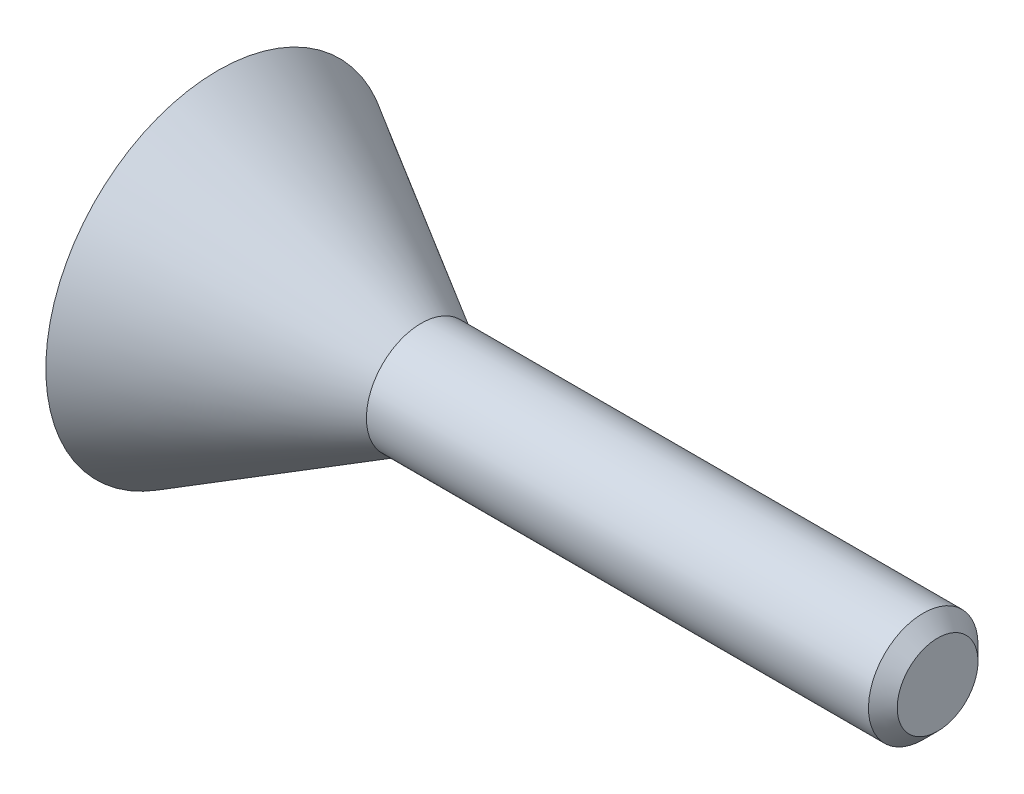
ISO-10303-21;
HEADER;
FILE_DESCRIPTION(('STEP AP214'),'2;1');
FILE_NAME('part.step','',(''),(''),'','','');
FILE_SCHEMA(('AUTOMOTIVE_DESIGN { 1 0 10303 214 1 1 1 1 }'));
ENDSEC;
DATA;
#1=APPLICATION_CONTEXT('core data for automotive mechanical design processes');
#2=APPLICATION_PROTOCOL_DEFINITION('international standard','automotive_design',2000,#1);
#3=PRODUCT_CONTEXT('',#1,'mechanical');
#4=PRODUCT('Part','Part','',(#3));
#5=PRODUCT_RELATED_PRODUCT_CATEGORY('part','',(#4));
#6=PRODUCT_DEFINITION_FORMATION('','',#4);
#7=PRODUCT_DEFINITION_CONTEXT('part definition',#1,'design');
#8=PRODUCT_DEFINITION('design','',#6,#7);
#9=PRODUCT_DEFINITION_SHAPE('','',#8);
#10=(LENGTH_UNIT() NAMED_UNIT(*) SI_UNIT(.MILLI.,.METRE.));
#11=(NAMED_UNIT(*) PLANE_ANGLE_UNIT() SI_UNIT($,.RADIAN.));
#12=(NAMED_UNIT(*) SI_UNIT($,.STERADIAN.) SOLID_ANGLE_UNIT());
#13=UNCERTAINTY_MEASURE_WITH_UNIT(LENGTH_MEASURE(1.E-05),#10,'distance_accuracy_value','');
#14=(GEOMETRIC_REPRESENTATION_CONTEXT(3) GLOBAL_UNCERTAINTY_ASSIGNED_CONTEXT((#13)) GLOBAL_UNIT_ASSIGNED_CONTEXT((#10,
#11,#12)) REPRESENTATION_CONTEXT('',''));
#15=CARTESIAN_POINT('',(0.,0.,0.));
#16=DIRECTION('',(0.,0.,1.));
#17=DIRECTION('',(1.,0.,0.));
#18=AXIS2_PLACEMENT_3D('',#15,#16,#17);
#19=CARTESIAN_POINT('',(-11.5,0.,0.));
#20=DIRECTION('',(1.,0.,0.));
#21=DIRECTION('',(0.,0.,-1.));
#22=AXIS2_PLACEMENT_3D('',#19,#20,#21);
#23=PLANE('',#22);
#24=DIRECTION('',(0.,-1.,0.));
#25=VECTOR('',#24,1.);
#26=CARTESIAN_POINT('',(-11.5,2.07734399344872,-3.31183973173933));
#27=LINE('',#26,#25);
#28=CARTESIAN_POINT('',(-11.5,2.07734399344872,-3.31183973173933));
#29=VERTEX_POINT('',#28);
#30=CARTESIAN_POINT('',(-11.5,1.57572061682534,-3.31183973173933));
#31=VERTEX_POINT('',#30);
#32=EDGE_CURVE('E298',#29,#31,#27,.T.);
#33=ORIENTED_EDGE('',*,*,#32,.F.);
#34=DIRECTION('',(0.,0.,-1.));
#35=VECTOR('',#34,1.);
#36=CARTESIAN_POINT('',(-11.5,2.07734399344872,-1.0358657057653));
#37=LINE('',#36,#35);
#38=CARTESIAN_POINT('',(-11.5,2.07734399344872,-1.0358657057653));
#39=VERTEX_POINT('',#38);
#40=EDGE_CURVE('E54',#39,#29,#37,.T.);
#41=ORIENTED_EDGE('',*,*,#40,.F.);
#42=DIRECTION('',(0.,1.,0.));
#43=VECTOR('',#42,1.);
#44=CARTESIAN_POINT('',(-11.5,0.726694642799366,-1.0358657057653));
#45=LINE('',#44,#43);
#46=CARTESIAN_POINT('',(-11.5,0.726694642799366,-1.0358657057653));
#47=VERTEX_POINT('',#46);
#48=EDGE_CURVE('E275',#47,#39,#45,.T.);
#49=ORIENTED_EDGE('',*,*,#48,.F.);
#50=DIRECTION('',(0.,0.,1.));
#51=VECTOR('',#50,1.);
#52=CARTESIAN_POINT('',(-11.5,0.726694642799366,-1.78667739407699));
#53=LINE('',#52,#51);
#54=CARTESIAN_POINT('',(-11.5,0.726694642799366,-1.78667739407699));
#55=VERTEX_POINT('',#54);
#56=EDGE_CURVE('E278',#55,#47,#53,.T.);
#57=ORIENTED_EDGE('',*,*,#56,.F.);
#58=DIRECTION('',(0.,-1.,0.));
#59=VECTOR('',#58,1.);
#60=CARTESIAN_POINT('',(-11.5,1.35007126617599,-1.78667739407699));
#61=LINE('',#60,#59);
#62=CARTESIAN_POINT('',(-11.5,1.35007126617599,-1.78667739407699));
#63=VERTEX_POINT('',#62);
#64=EDGE_CURVE('E312',#63,#55,#61,.T.);
#65=ORIENTED_EDGE('',*,*,#64,.F.);
#66=DIRECTION('',(0.,0.,1.));
#67=VECTOR('',#66,1.);
#68=CARTESIAN_POINT('',(-11.5,1.35007126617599,-2.47093064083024));
#69=LINE('',#68,#67);
#70=CARTESIAN_POINT('',(-11.5,1.35007126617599,-2.47093064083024));
#71=VERTEX_POINT('',#70);
#72=EDGE_CURVE('E309',#71,#63,#69,.T.);
#73=ORIENTED_EDGE('',*,*,#72,.F.);
#74=DIRECTION('',(0.,0.966781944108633,-0.255602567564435));
#75=VECTOR('',#74,1.);
#76=CARTESIAN_POINT('',(-11.5,-1.92265600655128,-1.6056709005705));
#77=LINE('',#76,#75);
#78=CARTESIAN_POINT('',(-11.5,-1.92265600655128,-1.6056709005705));
#79=VERTEX_POINT('',#78);
#80=EDGE_CURVE('E306',#79,#71,#77,.T.);
#81=ORIENTED_EDGE('',*,*,#80,.F.);
#82=DIRECTION('',(0.,0.,1.));
#83=VECTOR('',#82,1.);
#84=CARTESIAN_POINT('',(-11.5,-1.92265600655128,-2.41898258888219));
#85=LINE('',#84,#83);
#86=CARTESIAN_POINT('',(-11.5,-1.92265600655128,-2.41898258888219));
#87=VERTEX_POINT('',#86);
#88=EDGE_CURVE('E303',#87,#79,#85,.T.);
#89=ORIENTED_EDGE('',*,*,#88,.F.);
#90=DIRECTION('',(0.,-0.968940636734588,0.247293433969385));
#91=VECTOR('',#90,1.);
#92=CARTESIAN_POINT('',(-11.5,1.57572061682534,-3.31183973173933));
#93=LINE('',#92,#91);
#94=EDGE_CURVE('E300',#31,#87,#93,.T.);
#95=ORIENTED_EDGE('',*,*,#94,.F.);
#96=EDGE_LOOP('',(#33,#41,#49,#57,#65,#73,#81,#89,#95));
#97=FACE_BOUND('',#96,.T.);
#98=DIRECTION('',(0.,1.,0.));
#99=VECTOR('',#98,1.);
#100=CARTESIAN_POINT('',(-11.5,-1.92265600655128,3.41072520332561));
#101=LINE('',#100,#99);
#102=CARTESIAN_POINT('',(-11.5,-1.92265600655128,3.41072520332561));
#103=VERTEX_POINT('',#102);
#104=CARTESIAN_POINT('',(-11.5,-1.24246120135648,3.41072520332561));
#105=VERTEX_POINT('',#104);
#106=EDGE_CURVE('E427',#103,#105,#101,.T.);
#107=ORIENTED_EDGE('',*,*,#106,.F.);
#108=DIRECTION('',(0.,0.,1.));
#109=VECTOR('',#108,1.);
#110=CARTESIAN_POINT('',(-11.5,-1.92265600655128,1.05520572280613));
#111=LINE('',#110,#109);
#112=CARTESIAN_POINT('',(-11.5,-1.92265600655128,1.05520572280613));
#113=VERTEX_POINT('',#112);
#114=EDGE_CURVE('E62',#113,#103,#111,.T.);
#115=ORIENTED_EDGE('',*,*,#114,.F.);
#116=DIRECTION('',(0.,-1.,0.));
#117=VECTOR('',#116,1.);
#118=CARTESIAN_POINT('',(-11.5,-1.19538327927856,1.05520572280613));
#119=LINE('',#118,#117);
#120=CARTESIAN_POINT('',(-11.5,-1.19538327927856,1.05520572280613));
#121=VERTEX_POINT('',#120);
#122=EDGE_CURVE('E336',#121,#113,#119,.T.);
#123=ORIENTED_EDGE('',*,*,#122,.F.);
#124=DIRECTION('',(0.,0.,-1.));
#125=VECTOR('',#124,1.);
#126=CARTESIAN_POINT('',(-11.5,-1.19538327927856,2.41640702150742));
#127=LINE('',#126,#125);
#128=CARTESIAN_POINT('',(-11.5,-1.19538327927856,2.41640702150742));
#129=VERTEX_POINT('',#128);
#130=EDGE_CURVE('E535',#129,#121,#127,.T.);
#131=ORIENTED_EDGE('',*,*,#130,.F.);
#132=DIRECTION('',(0.,-0.786034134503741,0.618183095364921));
#133=VECTOR('',#132,1.);
#134=CARTESIAN_POINT('',(-11.5,0.0513699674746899,1.43588754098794));
#135=LINE('',#134,#133);
#136=CARTESIAN_POINT('',(-11.5,0.0513699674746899,1.43588754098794));
#137=VERTEX_POINT('',#136);
#138=EDGE_CURVE('E538',#137,#129,#135,.T.);
#139=ORIENTED_EDGE('',*,*,#138,.F.);
#140=CARTESIAN_POINT('',(-11.5,1.08059074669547,1.07712130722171));
#141=CARTESIAN_POINT('',(-11.5,1.0350781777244,1.07815618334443));
#142=CARTESIAN_POINT('',(-11.5,0.943972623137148,1.08022776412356));
#143=CARTESIAN_POINT('',(-11.5,0.807620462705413,1.0989271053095));
#144=CARTESIAN_POINT('',(-11.5,0.671964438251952,1.12906073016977));
#145=CARTESIAN_POINT('',(-11.5,0.537659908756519,1.17044483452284));
#146=CARTESIAN_POINT('',(-11.5,0.407033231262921,1.22185448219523));
#147=CARTESIAN_POINT('',(-11.5,0.28187334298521,1.28355594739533));
#148=CARTESIAN_POINT('',(-11.5,0.162124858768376,1.35319396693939));
#149=CARTESIAN_POINT('',(-11.5,0.0882175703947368,1.40837579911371));
#150=CARTESIAN_POINT('',(-11.5,0.0513699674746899,1.43588754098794));
#151=B_SPLINE_CURVE_WITH_KNOTS('',3,(#140,#141,#142,#143,#144,#145,#146,#147,#148,#149,#150),
.UNSPECIFIED.,.F.,.F.,(4,1,1,1,1,1,1,1,4),(0.,0.123046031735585,0.246309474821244,
0.371480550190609,0.498560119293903,0.626024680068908,0.750715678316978,0.875715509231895,1.),.UNSPECIFIED.);
#152=CARTESIAN_POINT('',(-11.5,1.08059074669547,1.07712130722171));
#153=VERTEX_POINT('',#152);
#154=EDGE_CURVE('E541',#153,#137,#151,.T.);
#155=ORIENTED_EDGE('',*,*,#154,.F.);
#156=DIRECTION('',(0.,-1.,0.));
#157=VECTOR('',#156,1.);
#158=CARTESIAN_POINT('',(-11.5,1.08383749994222,1.07712130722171));
#159=LINE('',#158,#157);
#160=CARTESIAN_POINT('',(-11.5,1.08383749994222,1.07712130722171));
#161=VERTEX_POINT('',#160);
#162=EDGE_CURVE('E546',#161,#153,#159,.T.);
#163=ORIENTED_EDGE('',*,*,#162,.F.);
#164=CARTESIAN_POINT('',(-11.5,2.12929204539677,2.25488104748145));
#165=CARTESIAN_POINT('',(-11.5,2.12864583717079,2.20938981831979));
#166=CARTESIAN_POINT('',(-11.5,2.12738904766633,2.12091539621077));
#167=CARTESIAN_POINT('',(-11.5,2.11382239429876,1.99211194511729));
#168=CARTESIAN_POINT('',(-11.5,2.09334635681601,1.87092155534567));
#169=CARTESIAN_POINT('',(-11.5,2.06339090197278,1.75753924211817));
#170=CARTESIAN_POINT('',(-11.5,2.02431665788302,1.65242018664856));
#171=CARTESIAN_POINT('',(-11.5,1.97720274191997,1.55524948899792));
#172=CARTESIAN_POINT('',(-11.5,1.92164766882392,1.46582402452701));
#173=CARTESIAN_POINT('',(-11.5,1.85753268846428,1.38482865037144));
#174=CARTESIAN_POINT('',(-11.5,1.7860226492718,1.3119528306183));
#175=CARTESIAN_POINT('',(-11.5,1.7063917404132,1.2492264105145));
#176=CARTESIAN_POINT('',(-11.5,1.62024968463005,1.19492629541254));
#177=CARTESIAN_POINT('',(-11.5,1.52592568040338,1.15248026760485));
#178=CARTESIAN_POINT('',(-11.5,1.4256378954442,1.11753528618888));
#179=CARTESIAN_POINT('',(-11.5,1.31758868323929,1.09490895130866));
#180=CARTESIAN_POINT('',(-11.5,1.20305019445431,1.0796616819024));
#181=CARTESIAN_POINT('',(-11.5,1.12420457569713,1.07798151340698));
#182=CARTESIAN_POINT('',(-11.5,1.08383749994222,1.07712130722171));
#183=B_SPLINE_CURVE_WITH_KNOTS('',3,(#164,#165,#166,#167,#168,#169,#170,#171,#172,#173,#174,
#175,#176,#177,#178,#179,#180,#181,#182),.UNSPECIFIED.,.F.,.F.,(4,1,1,1,1,1,1,1,1,1,1,1,1,1,1,1,
4),(0.,0.0762312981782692,0.148259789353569,0.216860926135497,0.28210063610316,
0.344528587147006,0.404571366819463,0.462840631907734,0.520642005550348,0.577409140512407,
0.633580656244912,0.690215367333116,0.747647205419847,0.806597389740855,0.867894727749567,
0.932365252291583,1.),.UNSPECIFIED.);
#184=CARTESIAN_POINT('',(-11.5,2.12929204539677,2.25488104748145));
#185=VERTEX_POINT('',#184);
#186=EDGE_CURVE('E552',#185,#161,#183,.T.);
#187=ORIENTED_EDGE('',*,*,#186,.F.);
#188=CARTESIAN_POINT('',(-11.5,0.928805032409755,3.46023819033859));
#189=CARTESIAN_POINT('',(-11.5,0.975170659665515,3.45644128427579));
#190=CARTESIAN_POINT('',(-11.5,1.06567540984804,3.44902980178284));
#191=CARTESIAN_POINT('',(-11.5,1.19659466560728,3.42473174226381));
#192=CARTESIAN_POINT('',(-11.5,1.31991165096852,3.39332745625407));
#193=CARTESIAN_POINT('',(-11.5,1.43560188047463,3.35337697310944));
#194=CARTESIAN_POINT('',(-11.5,1.54232579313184,3.30204045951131));
#195=CARTESIAN_POINT('',(-11.5,1.64231442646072,3.24436232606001));
#196=CARTESIAN_POINT('',(-11.5,1.73247517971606,3.17498998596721));
#197=CARTESIAN_POINT('',(-11.5,1.81582500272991,3.09905223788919));
#198=CARTESIAN_POINT('',(-11.5,1.88923831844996,3.01447116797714));
#199=CARTESIAN_POINT('',(-11.5,1.95399871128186,2.92428450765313));
#200=CARTESIAN_POINT('',(-11.5,2.00788985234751,2.82712849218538));
#201=CARTESIAN_POINT('',(-11.5,2.0525957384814,2.72448015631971));
#202=CARTESIAN_POINT('',(-11.5,2.08652624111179,2.61520142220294));
#203=CARTESIAN_POINT('',(-11.5,2.1119427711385,2.50071973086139));
#204=CARTESIAN_POINT('',(-11.5,2.12660055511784,2.37972104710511));
#205=CARTESIAN_POINT('',(-11.5,2.12838122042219,2.29712804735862));
#206=CARTESIAN_POINT('',(-11.5,2.12929204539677,2.25488104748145));
#207=B_SPLINE_CURVE_WITH_KNOTS('',3,(#188,#189,#190,#191,#192,#193,#194,#195,#196,#197,#198,
#199,#200,#201,#202,#203,#204,#205,#206),.UNSPECIFIED.,.F.,.F.,(4,1,1,1,1,1,1,1,1,1,1,1,1,1,1,1,
4),(0.,0.0733268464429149,0.143132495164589,0.209679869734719,0.273918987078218,
0.33576228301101,0.396210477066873,0.45560885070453,0.514796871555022,0.573764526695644,
0.631900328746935,0.689592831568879,0.748648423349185,0.808163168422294,0.86976604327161,
0.933384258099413,1.),.UNSPECIFIED.);
#208=CARTESIAN_POINT('',(-11.5,0.928805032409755,3.46023819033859));
#209=VERTEX_POINT('',#208);
#210=EDGE_CURVE('E557',#209,#185,#207,.T.);
#211=ORIENTED_EDGE('',*,*,#210,.F.);
#212=DIRECTION('',(0.,1.,0.));
#213=VECTOR('',#212,1.);
#214=CARTESIAN_POINT('',(-11.5,0.92636996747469,3.46023819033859));
#215=LINE('',#214,#213);
#216=CARTESIAN_POINT('',(-11.5,0.92636996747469,3.46023819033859));
#217=VERTEX_POINT('',#216);
#218=EDGE_CURVE('E565',#217,#209,#215,.T.);
#219=ORIENTED_EDGE('',*,*,#218,.F.);
#220=DIRECTION('',(0.,0.,1.));
#221=VECTOR('',#220,1.);
#222=CARTESIAN_POINT('',(-11.5,0.92636996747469,2.69075767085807));
#223=LINE('',#222,#221);
#224=CARTESIAN_POINT('',(-11.5,0.92636996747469,2.69075767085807));
#225=VERTEX_POINT('',#224);
#226=EDGE_CURVE('E571',#225,#217,#223,.T.);
#227=ORIENTED_EDGE('',*,*,#226,.F.);
#228=DIRECTION('',(0.,-1.,0.));
#229=VECTOR('',#228,1.);
#230=CARTESIAN_POINT('',(-11.5,0.928805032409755,2.69075767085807));
#231=LINE('',#230,#229);
#232=CARTESIAN_POINT('',(-11.5,0.928805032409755,2.69075767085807));
#233=VERTEX_POINT('',#232);
#234=EDGE_CURVE('E574',#233,#225,#231,.T.);
#235=ORIENTED_EDGE('',*,*,#234,.F.);
#236=CARTESIAN_POINT('',(-11.5,1.40201931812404,2.24919922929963));
#237=CARTESIAN_POINT('',(-11.5,1.40087189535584,2.27860509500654));
#238=CARTESIAN_POINT('',(-11.5,1.39864241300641,2.33574171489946));
#239=CARTESIAN_POINT('',(-11.5,1.3739334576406,2.41662833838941));
#240=CARTESIAN_POINT('',(-11.5,1.3351756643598,2.48951507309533));
#241=CARTESIAN_POINT('',(-11.5,1.27987317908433,2.55234922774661));
#242=CARTESIAN_POINT('',(-11.5,1.21043881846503,2.60438066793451));
#243=CARTESIAN_POINT('',(-11.5,1.12867414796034,2.6466092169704));
#244=CARTESIAN_POINT('',(-11.5,1.03310294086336,2.67529052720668));
#245=CARTESIAN_POINT('',(-11.5,0.964689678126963,2.68543605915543));
#246=CARTESIAN_POINT('',(-11.5,0.928805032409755,2.69075767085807));
#247=B_SPLINE_CURVE_WITH_KNOTS('',3,(#236,#237,#238,#239,#240,#241,#242,#243,#244,#245,#246),
.UNSPECIFIED.,.F.,.F.,(4,1,1,1,1,1,1,1,4),(0.,0.122603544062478,0.238222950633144,
0.350089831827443,0.465559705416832,0.58502806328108,0.711014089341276,0.848418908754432,1.),.UNSPECIFIED.);
#248=CARTESIAN_POINT('',(-11.5,1.40201931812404,2.24919922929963));
#249=VERTEX_POINT('',#248);
#250=EDGE_CURVE('E577',#249,#233,#247,.T.);
#251=ORIENTED_EDGE('',*,*,#250,.F.);
#252=CARTESIAN_POINT('',(-11.5,1.06273360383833,1.84984857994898));
#253=CARTESIAN_POINT('',(-11.5,1.08830922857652,1.85095739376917));
#254=CARTESIAN_POINT('',(-11.5,1.13730804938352,1.85308170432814));
#255=CARTESIAN_POINT('',(-11.5,1.2063483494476,1.87309604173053));
#256=CARTESIAN_POINT('',(-11.5,1.2664719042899,1.90589846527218));
#257=CARTESIAN_POINT('',(-11.5,1.31613376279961,1.95287945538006));
#258=CARTESIAN_POINT('',(-11.5,1.35541330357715,2.01136719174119));
#259=CARTESIAN_POINT('',(-11.5,1.383095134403,2.08134939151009));
#260=CARTESIAN_POINT('',(-11.5,1.39896889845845,2.16191039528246));
#261=CARTESIAN_POINT('',(-11.5,1.40096719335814,2.2190923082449));
#262=CARTESIAN_POINT('',(-11.5,1.40201931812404,2.24919922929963));
#263=B_SPLINE_CURVE_WITH_KNOTS('',3,(#252,#253,#254,#255,#256,#257,#258,#259,#260,#261,#262),
.UNSPECIFIED.,.F.,.F.,(4,1,1,1,1,1,1,1,4),(0.,0.128749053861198,0.246662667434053,
0.359069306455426,0.47107757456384,0.588039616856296,0.711712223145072,0.848213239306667,1.),.UNSPECIFIED.);
#264=CARTESIAN_POINT('',(-11.5,1.06273360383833,1.84984857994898));
#265=VERTEX_POINT('',#264);
#266=EDGE_CURVE('E582',#265,#249,#263,.T.);
#267=ORIENTED_EDGE('',*,*,#266,.F.);
#268=DIRECTION('',(0.,1.,0.));
#269=VECTOR('',#268,1.);
#270=CARTESIAN_POINT('',(-11.5,1.05705178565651,1.84984857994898));
#271=LINE('',#270,#269);
#272=CARTESIAN_POINT('',(-11.5,1.05705178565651,1.84984857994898));
#273=VERTEX_POINT('',#272);
#274=EDGE_CURVE('E590',#273,#265,#271,.T.);
#275=ORIENTED_EDGE('',*,*,#274,.F.);
#276=CARTESIAN_POINT('',(-11.5,0.568415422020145,2.04384208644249));
#277=CARTESIAN_POINT('',(-11.5,0.608756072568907,2.01521247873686));
#278=CARTESIAN_POINT('',(-11.5,0.687358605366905,1.95942855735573));
#279=CARTESIAN_POINT('',(-11.5,0.795303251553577,1.90893980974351));
#280=CARTESIAN_POINT('',(-11.5,0.879933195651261,1.87748740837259));
#281=CARTESIAN_POINT('',(-11.5,0.941306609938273,1.86249788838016));
#282=CARTESIAN_POINT('',(-11.5,0.999862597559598,1.85180483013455));
#283=CARTESIAN_POINT('',(-11.5,1.03833865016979,1.85048869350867));
#284=CARTESIAN_POINT('',(-11.5,1.05705178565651,1.84984857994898));
#285=B_SPLINE_CURVE_WITH_KNOTS('',3,(#276,#277,#278,#279,#280,#281,#282,#283,#284),
.UNSPECIFIED.,.F.,.F.,(4,1,1,1,1,1,4),(0.,0.277375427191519,0.540457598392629,0.666416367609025,
0.784009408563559,0.894951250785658,1.),.UNSPECIFIED.);
#286=CARTESIAN_POINT('',(-11.5,0.568415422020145,2.04384208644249));
#287=VERTEX_POINT('',#286);
#288=EDGE_CURVE('E596',#287,#273,#285,.T.);
#289=ORIENTED_EDGE('',*,*,#288,.F.);
#290=DIRECTION('',(0.,0.798150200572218,-0.602458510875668));
#291=VECTOR('',#290,1.);
#292=CARTESIAN_POINT('',(-11.5,-1.24246120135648,3.41072520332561));
#293=LINE('',#292,#291);
#294=EDGE_CURVE('E601',#105,#287,#293,.T.);
#295=ORIENTED_EDGE('',*,*,#294,.F.);
#296=EDGE_LOOP('',(#107,#115,#123,#131,#139,#155,#163,#187,#211,#219,#227,#235,#251,#267,#275,
#289,#295));
#297=FACE_BOUND('',#296,.T.);
#298=DIRECTION('',(0.,1.,0.));
#299=VECTOR('',#298,1.);
#300=CARTESIAN_POINT('',(-11.5,3.15,0.42));
#301=LINE('',#300,#299);
#302=CARTESIAN_POINT('',(-11.5,-4.07,0.420000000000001));
#303=VERTEX_POINT('',#302);
#304=CARTESIAN_POINT('',(-11.5,3.15,0.42));
#305=VERTEX_POINT('',#304);
#306=EDGE_CURVE('E433',#303,#305,#301,.T.);
#307=ORIENTED_EDGE('',*,*,#306,.F.);
#308=CARTESIAN_POINT('',(-11.5,-4.07,0.));
#309=DIRECTION('',(-1.,0.,0.));
#310=DIRECTION('',(0.,0.,1.));
#311=AXIS2_PLACEMENT_3D('',#308,#309,#310);
#312=CIRCLE('',#311,0.42);
#313=CARTESIAN_POINT('',(-11.5,-4.07,-0.419999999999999));
#314=VERTEX_POINT('',#313);
#315=EDGE_CURVE('E477',#314,#303,#312,.T.);
#316=ORIENTED_EDGE('',*,*,#315,.F.);
#317=DIRECTION('',(0.,-1.,0.));
#318=VECTOR('',#317,1.);
#319=CARTESIAN_POINT('',(-11.5,3.15,-0.42));
#320=LINE('',#319,#318);
#321=CARTESIAN_POINT('',(-11.5,3.15,-0.42));
#322=VERTEX_POINT('',#321);
#323=EDGE_CURVE('E460',#322,#314,#320,.T.);
#324=ORIENTED_EDGE('',*,*,#323,.F.);
#325=DIRECTION('',(0.,0.,1.));
#326=VECTOR('',#325,1.);
#327=CARTESIAN_POINT('',(-11.5,3.15,-1.01));
#328=LINE('',#327,#326);
#329=CARTESIAN_POINT('',(-11.5,3.15,-1.01));
#330=VERTEX_POINT('',#329);
#331=EDGE_CURVE('E464',#330,#322,#328,.T.);
#332=ORIENTED_EDGE('',*,*,#331,.F.);
#333=DIRECTION('',(0.,-0.857042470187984,-0.515245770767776));
#334=VECTOR('',#333,1.);
#335=CARTESIAN_POINT('',(-11.5,4.83,0.));
#336=LINE('',#335,#334);
#337=CARTESIAN_POINT('',(-11.5,4.83,0.));
#338=VERTEX_POINT('',#337);
#339=EDGE_CURVE('E467',#338,#330,#336,.T.);
#340=ORIENTED_EDGE('',*,*,#339,.F.);
#341=DIRECTION('',(0.,0.857042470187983,-0.515245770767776));
#342=VECTOR('',#341,1.);
#343=CARTESIAN_POINT('',(-11.5,4.83,0.));
#344=LINE('',#343,#342);
#345=CARTESIAN_POINT('',(-11.5,3.15,1.01));
#346=VERTEX_POINT('',#345);
#347=EDGE_CURVE('E470',#346,#338,#344,.T.);
#348=ORIENTED_EDGE('',*,*,#347,.F.);
#349=DIRECTION('',(0.,0.,1.));
#350=VECTOR('',#349,1.);
#351=CARTESIAN_POINT('',(-11.5,3.15,1.01));
#352=LINE('',#351,#350);
#353=EDGE_CURVE('E473',#305,#346,#352,.T.);
#354=ORIENTED_EDGE('',*,*,#353,.F.);
#355=EDGE_LOOP('',(#307,#316,#324,#332,#340,#348,#354));
#356=FACE_BOUND('',#355,.T.);
#357=CARTESIAN_POINT('',(-11.5,0.,0.));
#358=DIRECTION('',(-1.,0.,0.));
#359=DIRECTION('',(0.,-1.,0.));
#360=AXIS2_PLACEMENT_3D('',#357,#358,#359);
#361=CIRCLE('',#360,5.5);
#362=CARTESIAN_POINT('',(-11.5,-5.5,0.));
#363=VERTEX_POINT('',#362);
#364=EDGE_CURVE('E436',#363,#363,#361,.T.);
#365=ORIENTED_EDGE('',*,*,#364,.T.);
#366=EDGE_LOOP('',(#365));
#367=FACE_BOUND('',#366,.T.);
#368=ADVANCED_FACE('F39',(#97,#297,#356,#367),#23,.F.);
#369=CARTESIAN_POINT('',(-11.5,0.,0.));
#370=DIRECTION('',(-1.,0.,0.));
#371=DIRECTION('',(0.,-1.,0.));
#372=AXIS2_PLACEMENT_3D('',#369,#370,#371);
#373=CONICAL_SURFACE('',#372,5.5,0.523598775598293);
#374=CARTESIAN_POINT('',(-5.00480947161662,0.,0.));
#375=DIRECTION('',(-1.,0.,0.));
#376=DIRECTION('',(0.,-1.,0.));
#377=AXIS2_PLACEMENT_3D('',#374,#375,#376);
#378=CIRCLE('',#377,1.75);
#379=CARTESIAN_POINT('',(-5.00480947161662,-1.75,0.));
#380=VERTEX_POINT('',#379);
#381=EDGE_CURVE('E438',#380,#380,#378,.T.);
#382=CARTESIAN_POINT('',(-5.00480947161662,-1.75,0.));
#383=CARTESIAN_POINT('',(-5.07246770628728,-1.7890625,0.));
#384=CARTESIAN_POINT('',(-5.14012594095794,-1.828125,0.));
#385=CARTESIAN_POINT('',(-5.27544241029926,-1.90625,0.));
#386=CARTESIAN_POINT('',(-5.34310064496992,-1.9453125,0.));
#387=CARTESIAN_POINT('',(-5.47841711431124,-2.0234375,0.));
#388=CARTESIAN_POINT('',(-5.5460753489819,-2.0625,0.));
#389=CARTESIAN_POINT('',(-5.68139181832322,-2.140625,0.));
#390=CARTESIAN_POINT('',(-5.74905005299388,-2.1796875,0.));
#391=CARTESIAN_POINT('',(-5.8843665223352,-2.2578125,0.));
#392=CARTESIAN_POINT('',(-5.95202475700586,-2.296875,0.));
#393=CARTESIAN_POINT('',(-6.08734122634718,-2.375,0.));
#394=CARTESIAN_POINT('',(-6.15499946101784,-2.4140625,0.));
#395=CARTESIAN_POINT('',(-6.29031593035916,-2.4921875,0.));
#396=CARTESIAN_POINT('',(-6.35797416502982,-2.53125,0.));
#397=CARTESIAN_POINT('',(-6.49329063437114,-2.609375,0.));
#398=CARTESIAN_POINT('',(-6.5609488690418,-2.6484375,0.));
#399=CARTESIAN_POINT('',(-6.69626533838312,-2.7265625,0.));
#400=CARTESIAN_POINT('',(-6.76392357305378,-2.765625,0.));
#401=CARTESIAN_POINT('',(-6.89924004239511,-2.84375,0.));
#402=CARTESIAN_POINT('',(-6.96689827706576,-2.8828125,0.));
#403=CARTESIAN_POINT('',(-7.10221474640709,-2.9609375,0.));
#404=CARTESIAN_POINT('',(-7.16987298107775,-3.,0.));
#405=CARTESIAN_POINT('',(-7.30518945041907,-3.078125,0.));
#406=CARTESIAN_POINT('',(-7.37284768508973,-3.1171875,0.));
#407=CARTESIAN_POINT('',(-7.50816415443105,-3.1953125,0.));
#408=CARTESIAN_POINT('',(-7.57582238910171,-3.234375,0.));
#409=CARTESIAN_POINT('',(-7.71113885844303,-3.3125,0.));
#410=CARTESIAN_POINT('',(-7.77879709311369,-3.3515625,0.));
#411=CARTESIAN_POINT('',(-7.91411356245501,-3.4296875,0.));
#412=CARTESIAN_POINT('',(-7.98177179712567,-3.46875,0.));
#413=CARTESIAN_POINT('',(-8.11708826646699,-3.546875,0.));
#414=CARTESIAN_POINT('',(-8.18474650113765,-3.5859375,0.));
#415=CARTESIAN_POINT('',(-8.32006297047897,-3.6640625,0.));
#416=CARTESIAN_POINT('',(-8.38772120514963,-3.703125,0.));
#417=CARTESIAN_POINT('',(-8.52303767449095,-3.78125,0.));
#418=CARTESIAN_POINT('',(-8.59069590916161,-3.8203125,0.));
#419=CARTESIAN_POINT('',(-8.72601237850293,-3.8984375,0.));
#420=CARTESIAN_POINT('',(-8.79367061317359,-3.9375,0.));
#421=CARTESIAN_POINT('',(-8.92898708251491,-4.015625,0.));
#422=CARTESIAN_POINT('',(-8.99664531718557,-4.0546875,0.));
#423=CARTESIAN_POINT('',(-9.13196178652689,-4.1328125,0.));
#424=CARTESIAN_POINT('',(-9.19962002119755,-4.171875,0.));
#425=CARTESIAN_POINT('',(-9.33493649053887,-4.25,0.));
#426=CARTESIAN_POINT('',(-9.40259472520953,-4.2890625,0.));
#427=CARTESIAN_POINT('',(-9.53791119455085,-4.3671875,0.));
#428=CARTESIAN_POINT('',(-9.60556942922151,-4.40625,0.));
#429=CARTESIAN_POINT('',(-9.74088589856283,-4.484375,0.));
#430=CARTESIAN_POINT('',(-9.80854413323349,-4.5234375,0.));
#431=CARTESIAN_POINT('',(-9.94386060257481,-4.6015625,0.));
#432=CARTESIAN_POINT('',(-10.0115188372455,-4.640625,0.));
#433=CARTESIAN_POINT('',(-10.1468353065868,-4.71875,0.));
#434=CARTESIAN_POINT('',(-10.2144935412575,-4.7578125,0.));
#435=CARTESIAN_POINT('',(-10.3498100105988,-4.8359375,0.));
#436=CARTESIAN_POINT('',(-10.4174682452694,-4.875,0.));
#437=CARTESIAN_POINT('',(-10.5527847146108,-4.953125,0.));
#438=CARTESIAN_POINT('',(-10.6204429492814,-4.9921875,0.));
#439=CARTESIAN_POINT('',(-10.7557594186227,-5.0703125,0.));
#440=CARTESIAN_POINT('',(-10.8234176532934,-5.109375,0.));
#441=CARTESIAN_POINT('',(-10.9587341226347,-5.1875,0.));
#442=CARTESIAN_POINT('',(-11.0263923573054,-5.2265625,0.));
#443=CARTESIAN_POINT('',(-11.1617088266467,-5.3046875,0.));
#444=CARTESIAN_POINT('',(-11.2293670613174,-5.34375,0.));
#445=CARTESIAN_POINT('',(-11.3646835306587,-5.421875,0.));
#446=CARTESIAN_POINT('',(-11.4323417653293,-5.4609375,0.));
#447=CARTESIAN_POINT('',(-11.5,-5.5,0.));
#448=B_SPLINE_CURVE_WITH_KNOTS('',3,(#382,#383,#384,#385,#386,#387,#388,#389,#390,#391,#392,
#393,#394,#395,#396,#397,#398,#399,#400,#401,#402,#403,#404,#405,#406,#407,#408,#409,#410,#411,
#412,#413,#414,#415,#416,#417,#418,#419,#420,#421,#422,#423,#424,#425,#426,#427,#428,#429,#430,
#431,#432,#433,#434,#435,#436,#437,#438,#439,#440,#441,#442,#443,#444,#445,#446,#447),
.UNSPECIFIED.,.F.,.F.,(4,2,2,2,2,2,2,2,2,2,2,2,2,2,2,2,2,2,2,2,2,2,2,2,2,2,2,2,2,2,2,2,4),(0.,
0.234375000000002,0.468750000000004,0.703125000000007,0.93750000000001,1.17187500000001,
1.40625000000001,1.64062500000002,1.87500000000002,2.10937500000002,2.34375000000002,
2.57812500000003,2.81250000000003,3.04687500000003,3.28125000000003,3.51562500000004,
3.75000000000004,3.98437500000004,4.21875000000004,4.45312500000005,4.68750000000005,
4.92187500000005,5.15625000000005,5.39062500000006,5.62500000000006,5.85937500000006,
6.09375000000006,6.32812500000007,6.56250000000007,6.79687500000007,7.03125000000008,
7.26562500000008,7.50000000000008),.UNSPECIFIED.);
#449=EDGE_CURVE('BSEAM410',#380,#363,#448,.T.);
#450=ORIENTED_EDGE('',*,*,#381,.T.);
#451=ORIENTED_EDGE('',*,*,#364,.F.);
#452=ORIENTED_EDGE('',*,*,#449,.T.);
#453=ORIENTED_EDGE('',*,*,#449,.F.);
#454=EDGE_LOOP('',(#450,#452,#451,#453));
#455=FACE_BOUND('',#454,.T.);
#456=ADVANCED_FACE('F410',(#455),#373,.T.);
#457=CARTESIAN_POINT('',(-11.5,0.,0.));
#458=DIRECTION('',(-1.,0.,0.));
#459=DIRECTION('',(0.,-1.,0.));
#460=AXIS2_PLACEMENT_3D('',#457,#458,#459);
#461=CYLINDRICAL_SURFACE('',#460,1.75);
#462=CARTESIAN_POINT('',(11.04,0.,0.));
#463=DIRECTION('',(1.,0.,0.));
#464=DIRECTION('',(0.,1.,0.));
#465=AXIS2_PLACEMENT_3D('',#462,#463,#464);
#466=CIRCLE('',#465,1.75);
#467=CARTESIAN_POINT('',(11.04,-1.75,0.));
#468=VERTEX_POINT('',#467);
#469=EDGE_CURVE('E47',#468,#468,#466,.F.);
#470=ORIENTED_EDGE('',*,*,#469,.T.);
#471=EDGE_LOOP('',(#470));
#472=FACE_BOUND('',#471,.T.);
#473=ORIENTED_EDGE('',*,*,#381,.F.);
#474=EDGE_LOOP('',(#473));
#475=FACE_BOUND('',#474,.T.);
#476=ADVANCED_FACE('F407',(#472,#475),#461,.T.);
#477=CARTESIAN_POINT('',(11.5,0.,0.));
#478=DIRECTION('',(1.,0.,0.));
#479=DIRECTION('',(0.,0.,-1.));
#480=AXIS2_PLACEMENT_3D('',#477,#478,#479);
#481=PLANE('',#480);
#482=CARTESIAN_POINT('',(11.5,0.,0.));
#483=DIRECTION('',(1.,0.,0.));
#484=DIRECTION('',(0.,0.,-1.));
#485=AXIS2_PLACEMENT_3D('',#482,#483,#484);
#486=CIRCLE('',#485,1.29);
#487=CARTESIAN_POINT('',(11.5,-1.29,0.));
#488=VERTEX_POINT('',#487);
#489=EDGE_CURVE('E11',#488,#488,#486,.T.);
#490=ORIENTED_EDGE('',*,*,#489,.T.);
#491=EDGE_LOOP('',(#490));
#492=FACE_BOUND('',#491,.T.);
#493=ADVANCED_FACE('F405',(#492),#481,.T.);
#494=CARTESIAN_POINT('',(-10.9,-4.07,0.));
#495=DIRECTION('',(-1.,0.,0.));
#496=DIRECTION('',(0.,0.,1.));
#497=AXIS2_PLACEMENT_3D('',#494,#495,#496);
#498=CYLINDRICAL_SURFACE('',#497,0.42);
#499=ORIENTED_EDGE('',*,*,#315,.T.);
#500=DIRECTION('',(-1.,0.,0.));
#501=VECTOR('',#500,1.);
#502=CARTESIAN_POINT('',(-10.9,-4.07,0.420000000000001));
#503=LINE('',#502,#501);
#504=CARTESIAN_POINT('',(-10.9,-4.07,0.420000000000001));
#505=VERTEX_POINT('',#504);
#506=EDGE_CURVE('E445',#505,#303,#503,.T.);
#507=ORIENTED_EDGE('',*,*,#506,.F.);
#508=CARTESIAN_POINT('',(-10.9,-4.07,0.));
#509=DIRECTION('',(-1.,0.,0.));
#510=DIRECTION('',(0.,0.,1.));
#511=AXIS2_PLACEMENT_3D('',#508,#509,#510);
#512=CIRCLE('',#511,0.42);
#513=CARTESIAN_POINT('',(-10.9,-4.07,-0.419999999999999));
#514=VERTEX_POINT('',#513);
#515=EDGE_CURVE('E463',#514,#505,#512,.T.);
#516=ORIENTED_EDGE('',*,*,#515,.F.);
#517=DIRECTION('',(-1.,0.,0.));
#518=VECTOR('',#517,1.);
#519=CARTESIAN_POINT('',(-10.9,-4.07,-0.419999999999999));
#520=LINE('',#519,#518);
#521=EDGE_CURVE('E442',#514,#314,#520,.T.);
#522=ORIENTED_EDGE('',*,*,#521,.T.);
#523=EDGE_LOOP('',(#499,#507,#516,#522));
#524=FACE_BOUND('',#523,.T.);
#525=ADVANCED_FACE('F383',(#524),#498,.F.);
#526=CARTESIAN_POINT('',(-10.9,3.15,-0.42));
#527=DIRECTION('',(0.,0.,-1.));
#528=DIRECTION('',(0.,1.,0.));
#529=AXIS2_PLACEMENT_3D('',#526,#527,#528);
#530=PLANE('',#529);
#531=ORIENTED_EDGE('',*,*,#323,.T.);
#532=ORIENTED_EDGE('',*,*,#521,.F.);
#533=DIRECTION('',(0.,-1.,0.));
#534=VECTOR('',#533,1.);
#535=CARTESIAN_POINT('',(-10.9,3.15,-0.42));
#536=LINE('',#535,#534);
#537=CARTESIAN_POINT('',(-10.9,3.15,-0.42));
#538=VERTEX_POINT('',#537);
#539=EDGE_CURVE('E449',#538,#514,#536,.T.);
#540=ORIENTED_EDGE('',*,*,#539,.F.);
#541=DIRECTION('',(-1.,0.,0.));
#542=VECTOR('',#541,1.);
#543=CARTESIAN_POINT('',(-10.9,3.15,-0.42));
#544=LINE('',#543,#542);
#545=EDGE_CURVE('E457',#538,#322,#544,.T.);
#546=ORIENTED_EDGE('',*,*,#545,.T.);
#547=EDGE_LOOP('',(#531,#532,#540,#546));
#548=FACE_BOUND('',#547,.T.);
#549=ADVANCED_FACE('F379',(#548),#530,.F.);
#550=CARTESIAN_POINT('',(-10.9,3.15,-1.01));
#551=DIRECTION('',(0.,-1.,0.));
#552=DIRECTION('',(0.,0.,-1.));
#553=AXIS2_PLACEMENT_3D('',#550,#551,#552);
#554=PLANE('',#553);
#555=ORIENTED_EDGE('',*,*,#331,.T.);
#556=ORIENTED_EDGE('',*,*,#545,.F.);
#557=DIRECTION('',(0.,0.,1.));
#558=VECTOR('',#557,1.);
#559=CARTESIAN_POINT('',(-10.9,3.15,-1.01));
#560=LINE('',#559,#558);
#561=CARTESIAN_POINT('',(-10.9,3.15,-1.01));
#562=VERTEX_POINT('',#561);
#563=EDGE_CURVE('E482',#562,#538,#560,.T.);
#564=ORIENTED_EDGE('',*,*,#563,.F.);
#565=DIRECTION('',(-1.,0.,0.));
#566=VECTOR('',#565,1.);
#567=CARTESIAN_POINT('',(-10.9,3.15,-1.01));
#568=LINE('',#567,#566);
#569=EDGE_CURVE('E455',#562,#330,#568,.T.);
#570=ORIENTED_EDGE('',*,*,#569,.T.);
#571=EDGE_LOOP('',(#555,#556,#564,#570));
#572=FACE_BOUND('',#571,.T.);
#573=ADVANCED_FACE('F382',(#572),#554,.F.);
#574=CARTESIAN_POINT('',(-10.9,4.83,0.));
#575=DIRECTION('',(0.,0.515245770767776,-0.857042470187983));
#576=DIRECTION('',(0.,0.857042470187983,0.515245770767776));
#577=AXIS2_PLACEMENT_3D('',#574,#575,#576);
#578=PLANE('',#577);
#579=ORIENTED_EDGE('',*,*,#339,.T.);
#580=ORIENTED_EDGE('',*,*,#569,.F.);
#581=DIRECTION('',(0.,-0.857042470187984,-0.515245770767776));
#582=VECTOR('',#581,1.);
#583=CARTESIAN_POINT('',(-10.9,4.83,0.));
#584=LINE('',#583,#582);
#585=CARTESIAN_POINT('',(-10.9,4.83,0.));
#586=VERTEX_POINT('',#585);
#587=EDGE_CURVE('E485',#586,#562,#584,.T.);
#588=ORIENTED_EDGE('',*,*,#587,.F.);
#589=DIRECTION('',(-1.,0.,0.));
#590=VECTOR('',#589,1.);
#591=CARTESIAN_POINT('',(-10.9,4.83,0.));
#592=LINE('',#591,#590);
#593=EDGE_CURVE('E453',#586,#338,#592,.T.);
#594=ORIENTED_EDGE('',*,*,#593,.T.);
#595=EDGE_LOOP('',(#579,#580,#588,#594));
#596=FACE_BOUND('',#595,.T.);
#597=ADVANCED_FACE('F387',(#596),#578,.F.);
#598=CARTESIAN_POINT('',(-10.9,4.83,0.));
#599=DIRECTION('',(0.,0.515245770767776,0.857042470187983));
#600=DIRECTION('',(0.,-0.857042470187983,0.515245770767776));
#601=AXIS2_PLACEMENT_3D('',#598,#599,#600);
#602=PLANE('',#601);
#603=ORIENTED_EDGE('',*,*,#347,.T.);
#604=ORIENTED_EDGE('',*,*,#593,.F.);
#605=DIRECTION('',(0.,0.857042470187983,-0.515245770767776));
#606=VECTOR('',#605,1.);
#607=CARTESIAN_POINT('',(-10.9,4.83,0.));
#608=LINE('',#607,#606);
#609=CARTESIAN_POINT('',(-10.9,3.15,1.01));
#610=VERTEX_POINT('',#609);
#611=EDGE_CURVE('E488',#610,#586,#608,.T.);
#612=ORIENTED_EDGE('',*,*,#611,.F.);
#613=DIRECTION('',(-1.,0.,0.));
#614=VECTOR('',#613,1.);
#615=CARTESIAN_POINT('',(-10.9,3.15,1.01));
#616=LINE('',#615,#614);
#617=EDGE_CURVE('E451',#610,#346,#616,.T.);
#618=ORIENTED_EDGE('',*,*,#617,.T.);
#619=EDGE_LOOP('',(#603,#604,#612,#618));
#620=FACE_BOUND('',#619,.T.);
#621=ADVANCED_FACE('F391',(#620),#602,.F.);
#622=CARTESIAN_POINT('',(-10.9,3.15,1.01));
#623=DIRECTION('',(0.,-1.,0.));
#624=DIRECTION('',(0.,0.,-1.));
#625=AXIS2_PLACEMENT_3D('',#622,#623,#624);
#626=PLANE('',#625);
#627=ORIENTED_EDGE('',*,*,#353,.T.);
#628=ORIENTED_EDGE('',*,*,#617,.F.);
#629=DIRECTION('',(0.,0.,1.));
#630=VECTOR('',#629,1.);
#631=CARTESIAN_POINT('',(-10.9,3.15,1.01));
#632=LINE('',#631,#630);
#633=CARTESIAN_POINT('',(-10.9,3.15,0.42));
#634=VERTEX_POINT('',#633);
#635=EDGE_CURVE('E491',#634,#610,#632,.T.);
#636=ORIENTED_EDGE('',*,*,#635,.F.);
#637=DIRECTION('',(-1.,0.,0.));
#638=VECTOR('',#637,1.);
#639=CARTESIAN_POINT('',(-10.9,3.15,0.42));
#640=LINE('',#639,#638);
#641=EDGE_CURVE('E448',#634,#305,#640,.T.);
#642=ORIENTED_EDGE('',*,*,#641,.T.);
#643=EDGE_LOOP('',(#627,#628,#636,#642));
#644=FACE_BOUND('',#643,.T.);
#645=ADVANCED_FACE('F395',(#644),#626,.F.);
#646=CARTESIAN_POINT('',(-10.9,3.15,0.42));
#647=DIRECTION('',(0.,0.,1.));
#648=DIRECTION('',(0.,-1.,0.));
#649=AXIS2_PLACEMENT_3D('',#646,#647,#648);
#650=PLANE('',#649);
#651=ORIENTED_EDGE('',*,*,#306,.T.);
#652=ORIENTED_EDGE('',*,*,#641,.F.);
#653=DIRECTION('',(0.,1.,0.));
#654=VECTOR('',#653,1.);
#655=CARTESIAN_POINT('',(-10.9,3.15,0.42));
#656=LINE('',#655,#654);
#657=EDGE_CURVE('E494',#505,#634,#656,.T.);
#658=ORIENTED_EDGE('',*,*,#657,.F.);
#659=ORIENTED_EDGE('',*,*,#506,.T.);
#660=EDGE_LOOP('',(#651,#652,#658,#659));
#661=FACE_BOUND('',#660,.T.);
#662=ADVANCED_FACE('F377',(#661),#650,.F.);
#663=CARTESIAN_POINT('',(-10.9,-4.07,0.));
#664=DIRECTION('',(-1.,0.,0.));
#665=DIRECTION('',(0.,0.,1.));
#666=AXIS2_PLACEMENT_3D('',#663,#664,#665);
#667=PLANE('',#666);
#668=ORIENTED_EDGE('',*,*,#515,.T.);
#669=ORIENTED_EDGE('',*,*,#657,.T.);
#670=ORIENTED_EDGE('',*,*,#635,.T.);
#671=ORIENTED_EDGE('',*,*,#611,.T.);
#672=ORIENTED_EDGE('',*,*,#587,.T.);
#673=ORIENTED_EDGE('',*,*,#563,.T.);
#674=ORIENTED_EDGE('',*,*,#539,.T.);
#675=EDGE_LOOP('',(#668,#669,#670,#671,#672,#673,#674));
#676=FACE_BOUND('',#675,.T.);
#677=ADVANCED_FACE('F374',(#676),#667,.T.);
#678=CARTESIAN_POINT('',(11.04,0.,0.));
#679=DIRECTION('',(-1.,0.,0.));
#680=DIRECTION('',(0.,-1.,0.));
#681=AXIS2_PLACEMENT_3D('',#678,#679,#680);
#682=CONICAL_SURFACE('',#681,1.75,0.78539816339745);
#683=CARTESIAN_POINT('',(11.5,-1.29,0.));
#684=CARTESIAN_POINT('',(11.4952083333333,-1.29479166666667,0.));
#685=CARTESIAN_POINT('',(11.4904166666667,-1.29958333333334,0.));
#686=CARTESIAN_POINT('',(11.4808333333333,-1.30916666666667,0.));
#687=CARTESIAN_POINT('',(11.4760416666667,-1.31395833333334,0.));
#688=CARTESIAN_POINT('',(11.4664583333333,-1.32354166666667,0.));
#689=CARTESIAN_POINT('',(11.4616666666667,-1.32833333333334,0.));
#690=CARTESIAN_POINT('',(11.4520833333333,-1.33791666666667,0.));
#691=CARTESIAN_POINT('',(11.4472916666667,-1.34270833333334,0.));
#692=CARTESIAN_POINT('',(11.4377083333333,-1.35229166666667,0.));
#693=CARTESIAN_POINT('',(11.4329166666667,-1.35708333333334,0.));
#694=CARTESIAN_POINT('',(11.4233333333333,-1.36666666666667,0.));
#695=CARTESIAN_POINT('',(11.4185416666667,-1.37145833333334,0.));
#696=CARTESIAN_POINT('',(11.4089583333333,-1.38104166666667,0.));
#697=CARTESIAN_POINT('',(11.4041666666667,-1.38583333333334,0.));
#698=CARTESIAN_POINT('',(11.3945833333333,-1.39541666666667,0.));
#699=CARTESIAN_POINT('',(11.3897916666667,-1.40020833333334,0.));
#700=CARTESIAN_POINT('',(11.3802083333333,-1.40979166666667,0.));
#701=CARTESIAN_POINT('',(11.3754166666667,-1.41458333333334,0.));
#702=CARTESIAN_POINT('',(11.3658333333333,-1.42416666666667,0.));
#703=CARTESIAN_POINT('',(11.3610416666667,-1.42895833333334,0.));
#704=CARTESIAN_POINT('',(11.3514583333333,-1.43854166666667,0.));
#705=CARTESIAN_POINT('',(11.3466666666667,-1.44333333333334,0.));
#706=CARTESIAN_POINT('',(11.3370833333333,-1.45291666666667,0.));
#707=CARTESIAN_POINT('',(11.3322916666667,-1.45770833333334,0.));
#708=CARTESIAN_POINT('',(11.3227083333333,-1.46729166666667,0.));
#709=CARTESIAN_POINT('',(11.3179166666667,-1.47208333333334,0.));
#710=CARTESIAN_POINT('',(11.3083333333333,-1.48166666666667,0.));
#711=CARTESIAN_POINT('',(11.3035416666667,-1.48645833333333,0.));
#712=CARTESIAN_POINT('',(11.2939583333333,-1.49604166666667,0.));
#713=CARTESIAN_POINT('',(11.2891666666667,-1.50083333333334,0.));
#714=CARTESIAN_POINT('',(11.2795833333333,-1.51041666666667,0.));
#715=CARTESIAN_POINT('',(11.2747916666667,-1.51520833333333,0.));
#716=CARTESIAN_POINT('',(11.2652083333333,-1.52479166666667,0.));
#717=CARTESIAN_POINT('',(11.2604166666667,-1.52958333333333,0.));
#718=CARTESIAN_POINT('',(11.2508333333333,-1.53916666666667,0.));
#719=CARTESIAN_POINT('',(11.2460416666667,-1.54395833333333,0.));
#720=CARTESIAN_POINT('',(11.2364583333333,-1.55354166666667,0.));
#721=CARTESIAN_POINT('',(11.2316666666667,-1.55833333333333,0.));
#722=CARTESIAN_POINT('',(11.2220833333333,-1.56791666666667,0.));
#723=CARTESIAN_POINT('',(11.2172916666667,-1.57270833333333,0.));
#724=CARTESIAN_POINT('',(11.2077083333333,-1.58229166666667,0.));
#725=CARTESIAN_POINT('',(11.2029166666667,-1.58708333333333,0.));
#726=CARTESIAN_POINT('',(11.1933333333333,-1.59666666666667,0.));
#727=CARTESIAN_POINT('',(11.1885416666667,-1.60145833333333,0.));
#728=CARTESIAN_POINT('',(11.1789583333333,-1.61104166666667,0.));
#729=CARTESIAN_POINT('',(11.1741666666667,-1.61583333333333,0.));
#730=CARTESIAN_POINT('',(11.1645833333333,-1.62541666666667,0.));
#731=CARTESIAN_POINT('',(11.1597916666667,-1.63020833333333,0.));
#732=CARTESIAN_POINT('',(11.1502083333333,-1.63979166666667,0.));
#733=CARTESIAN_POINT('',(11.1454166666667,-1.64458333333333,0.));
#734=CARTESIAN_POINT('',(11.1358333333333,-1.65416666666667,0.));
#735=CARTESIAN_POINT('',(11.1310416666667,-1.65895833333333,0.));
#736=CARTESIAN_POINT('',(11.1214583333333,-1.66854166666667,0.));
#737=CARTESIAN_POINT('',(11.1166666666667,-1.67333333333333,0.));
#738=CARTESIAN_POINT('',(11.1070833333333,-1.68291666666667,0.));
#739=CARTESIAN_POINT('',(11.1022916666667,-1.68770833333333,0.));
#740=CARTESIAN_POINT('',(11.0927083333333,-1.69729166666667,0.));
#741=CARTESIAN_POINT('',(11.0879166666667,-1.70208333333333,0.));
#742=CARTESIAN_POINT('',(11.0783333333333,-1.71166666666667,0.));
#743=CARTESIAN_POINT('',(11.0735416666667,-1.71645833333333,0.));
#744=CARTESIAN_POINT('',(11.0639583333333,-1.72604166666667,0.));
#745=CARTESIAN_POINT('',(11.0591666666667,-1.73083333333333,0.));
#746=CARTESIAN_POINT('',(11.0495833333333,-1.74041666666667,0.));
#747=CARTESIAN_POINT('',(11.0447916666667,-1.74520833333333,0.));
#748=CARTESIAN_POINT('',(11.04,-1.75,0.));
#749=B_SPLINE_CURVE_WITH_KNOTS('',3,(#683,#684,#685,#686,#687,#688,#689,#690,#691,#692,#693,
#694,#695,#696,#697,#698,#699,#700,#701,#702,#703,#704,#705,#706,#707,#708,#709,#710,#711,#712,
#713,#714,#715,#716,#717,#718,#719,#720,#721,#722,#723,#724,#725,#726,#727,#728,#729,#730,#731,
#732,#733,#734,#735,#736,#737,#738,#739,#740,#741,#742,#743,#744,#745,#746,#747,#748),
.UNSPECIFIED.,.F.,.F.,(4,2,2,2,2,2,2,2,2,2,2,2,2,2,2,2,2,2,2,2,2,2,2,2,2,2,2,2,2,2,2,2,4),(0.,
0.0203293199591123,0.0406586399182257,0.060987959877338,0.0813172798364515,0.101646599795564,
0.121975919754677,0.142305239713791,0.162634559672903,0.182963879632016,0.203293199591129,
0.223622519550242,0.243951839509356,0.264281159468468,0.284610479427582,0.304939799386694,
0.325269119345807,0.345598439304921,0.365927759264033,0.386257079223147,0.406586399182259,
0.426915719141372,0.447245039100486,0.467574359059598,0.487903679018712,0.508232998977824,
0.528562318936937,0.548891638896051,0.569220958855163,0.589550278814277,0.609879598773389,
0.630208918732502,0.650538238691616),.UNSPECIFIED.);
#750=EDGE_CURVE('BSEAM41',#488,#468,#749,.T.);
#751=ORIENTED_EDGE('',*,*,#489,.F.);
#752=ORIENTED_EDGE('',*,*,#469,.F.);
#753=ORIENTED_EDGE('',*,*,#750,.T.);
#754=ORIENTED_EDGE('',*,*,#750,.F.);
#755=EDGE_LOOP('',(#751,#753,#752,#754));
#756=FACE_BOUND('',#755,.T.);
#757=ADVANCED_FACE('F41',(#756),#682,.T.);
#758=CARTESIAN_POINT('',(-10.9,-1.92265600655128,1.05520572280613));
#759=DIRECTION('',(0.,-1.,0.));
#760=DIRECTION('',(0.,0.,-1.));
#761=AXIS2_PLACEMENT_3D('',#758,#759,#760);
#762=PLANE('',#761);
#763=ORIENTED_EDGE('',*,*,#114,.T.);
#764=DIRECTION('',(-1.,0.,0.));
#765=VECTOR('',#764,1.);
#766=CARTESIAN_POINT('',(-10.9,-1.92265600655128,3.41072520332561));
#767=LINE('',#766,#765);
#768=CARTESIAN_POINT('',(-10.9,-1.92265600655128,3.41072520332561));
#769=VERTEX_POINT('',#768);
#770=EDGE_CURVE('E499',#769,#103,#767,.T.);
#771=ORIENTED_EDGE('',*,*,#770,.F.);
#772=DIRECTION('',(0.,0.,1.));
#773=VECTOR('',#772,1.);
#774=CARTESIAN_POINT('',(-10.9,-1.92265600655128,1.05520572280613));
#775=LINE('',#774,#773);
#776=CARTESIAN_POINT('',(-10.9,-1.92265600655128,1.05520572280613));
#777=VERTEX_POINT('',#776);
#778=EDGE_CURVE('E332',#777,#769,#775,.T.);
#779=ORIENTED_EDGE('',*,*,#778,.F.);
#780=DIRECTION('',(-1.,0.,0.));
#781=VECTOR('',#780,1.);
#782=CARTESIAN_POINT('',(-10.9,-1.92265600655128,1.05520572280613));
#783=LINE('',#782,#781);
#784=EDGE_CURVE('E479',#777,#113,#783,.T.);
#785=ORIENTED_EDGE('',*,*,#784,.T.);
#786=EDGE_LOOP('',(#763,#771,#779,#785));
#787=FACE_BOUND('',#786,.T.);
#788=ADVANCED_FACE('F370',(#787),#762,.F.);
#789=CARTESIAN_POINT('',(-10.9,-1.19538327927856,1.05520572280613));
#790=DIRECTION('',(0.,0.,-1.));
#791=DIRECTION('',(-1.,0.,0.));
#792=AXIS2_PLACEMENT_3D('',#789,#790,#791);
#793=PLANE('',#792);
#794=ORIENTED_EDGE('',*,*,#122,.T.);
#795=ORIENTED_EDGE('',*,*,#784,.F.);
#796=DIRECTION('',(0.,-1.,0.));
#797=VECTOR('',#796,1.);
#798=CARTESIAN_POINT('',(-10.9,-1.19538327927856,1.05520572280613));
#799=LINE('',#798,#797);
#800=CARTESIAN_POINT('',(-10.9,-1.19538327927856,1.05520572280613));
#801=VERTEX_POINT('',#800);
#802=EDGE_CURVE('E502',#801,#777,#799,.T.);
#803=ORIENTED_EDGE('',*,*,#802,.F.);
#804=DIRECTION('',(-1.,0.,0.));
#805=VECTOR('',#804,1.);
#806=CARTESIAN_POINT('',(-10.9,-1.19538327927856,1.05520572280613));
#807=LINE('',#806,#805);
#808=EDGE_CURVE('E530',#801,#121,#807,.T.);
#809=ORIENTED_EDGE('',*,*,#808,.T.);
#810=EDGE_LOOP('',(#794,#795,#803,#809));
#811=FACE_BOUND('',#810,.T.);
#812=ADVANCED_FACE('F373',(#811),#793,.F.);
#813=CARTESIAN_POINT('',(-10.9,-1.19538327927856,2.41640702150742));
#814=DIRECTION('',(0.,1.,0.));
#815=DIRECTION('',(0.,0.,1.));
#816=AXIS2_PLACEMENT_3D('',#813,#814,#815);
#817=PLANE('',#816);
#818=ORIENTED_EDGE('',*,*,#130,.T.);
#819=ORIENTED_EDGE('',*,*,#808,.F.);
#820=DIRECTION('',(0.,0.,-1.));
#821=VECTOR('',#820,1.);
#822=CARTESIAN_POINT('',(-10.9,-1.19538327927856,2.41640702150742));
#823=LINE('',#822,#821);
#824=CARTESIAN_POINT('',(-10.9,-1.19538327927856,2.41640702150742));
#825=VERTEX_POINT('',#824);
#826=EDGE_CURVE('E611',#825,#801,#823,.T.);
#827=ORIENTED_EDGE('',*,*,#826,.F.);
#828=DIRECTION('',(-1.,0.,0.));
#829=VECTOR('',#828,1.);
#830=CARTESIAN_POINT('',(-10.9,-1.19538327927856,2.41640702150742));
#831=LINE('',#830,#829);
#832=EDGE_CURVE('E528',#825,#129,#831,.T.);
#833=ORIENTED_EDGE('',*,*,#832,.T.);
#834=EDGE_LOOP('',(#818,#819,#827,#833));
#835=FACE_BOUND('',#834,.T.);
#836=ADVANCED_FACE('F724',(#835),#817,.F.);
#837=CARTESIAN_POINT('',(-10.9,0.0513699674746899,1.43588754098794));
#838=DIRECTION('',(0.,-0.618183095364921,-0.786034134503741));
#839=DIRECTION('',(0.,0.786034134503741,-0.618183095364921));
#840=AXIS2_PLACEMENT_3D('',#837,#838,#839);
#841=PLANE('',#840);
#842=ORIENTED_EDGE('',*,*,#138,.T.);
#843=ORIENTED_EDGE('',*,*,#832,.F.);
#844=DIRECTION('',(0.,-0.786034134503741,0.618183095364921));
#845=VECTOR('',#844,1.);
#846=CARTESIAN_POINT('',(-10.9,0.0513699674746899,1.43588754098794));
#847=LINE('',#846,#845);
#848=CARTESIAN_POINT('',(-10.9,0.0513699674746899,1.43588754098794));
#849=VERTEX_POINT('',#848);
#850=EDGE_CURVE('E614',#849,#825,#847,.T.);
#851=ORIENTED_EDGE('',*,*,#850,.F.);
#852=DIRECTION('',(-1.,0.,0.));
#853=VECTOR('',#852,1.);
#854=CARTESIAN_POINT('',(-10.9,0.0513699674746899,1.43588754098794));
#855=LINE('',#854,#853);
#856=EDGE_CURVE('E526',#849,#137,#855,.T.);
#857=ORIENTED_EDGE('',*,*,#856,.T.);
#858=EDGE_LOOP('',(#842,#843,#851,#857));
#859=FACE_BOUND('',#858,.T.);
#860=ADVANCED_FACE('F634',(#859),#841,.F.);
#861=CARTESIAN_POINT('',(-10.9,1.08059074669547,1.07712130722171));
#862=CARTESIAN_POINT('',(-10.9,1.0350781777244,1.07815618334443));
#863=CARTESIAN_POINT('',(-10.9,0.943972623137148,1.08022776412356));
#864=CARTESIAN_POINT('',(-10.9,0.807620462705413,1.0989271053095));
#865=CARTESIAN_POINT('',(-10.9,0.671964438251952,1.12906073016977));
#866=CARTESIAN_POINT('',(-10.9,0.537659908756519,1.17044483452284));
#867=CARTESIAN_POINT('',(-10.9,0.407033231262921,1.22185448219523));
#868=CARTESIAN_POINT('',(-10.9,0.28187334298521,1.28355594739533));
#869=CARTESIAN_POINT('',(-10.9,0.162124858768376,1.35319396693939));
#870=CARTESIAN_POINT('',(-10.9,0.0882175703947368,1.40837579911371));
#871=CARTESIAN_POINT('',(-10.9,0.0513699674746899,1.43588754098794));
#872=B_SPLINE_CURVE_WITH_KNOTS('',3,(#861,#862,#863,#864,#865,#866,#867,#868,#869,#870,#871),
.UNSPECIFIED.,.F.,.F.,(4,1,1,1,1,1,1,1,4),(0.,0.123046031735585,0.246309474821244,
0.371480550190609,0.498560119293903,0.626024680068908,0.750715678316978,0.875715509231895,1.),.UNSPECIFIED.);
#873=DIRECTION('',(-1.,0.,0.));
#874=VECTOR('',#873,1.);
#875=SURFACE_OF_LINEAR_EXTRUSION('',#872,#874);
#876=ORIENTED_EDGE('',*,*,#154,.T.);
#877=ORIENTED_EDGE('',*,*,#856,.F.);
#878=CARTESIAN_POINT('',(-10.9,1.08059074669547,1.07712130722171));
#879=VERTEX_POINT('',#878);
#880=EDGE_CURVE('E617',#879,#849,#872,.T.);
#881=ORIENTED_EDGE('',*,*,#880,.F.);
#882=DIRECTION('',(-1.,0.,0.));
#883=VECTOR('',#882,1.);
#884=CARTESIAN_POINT('',(-10.9,1.08059074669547,1.07712130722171));
#885=LINE('',#884,#883);
#886=EDGE_CURVE('E524',#879,#153,#885,.T.);
#887=ORIENTED_EDGE('',*,*,#886,.T.);
#888=EDGE_LOOP('',(#876,#877,#881,#887));
#889=FACE_BOUND('',#888,.T.);
#890=ADVANCED_FACE('F629',(#889),#875,.F.);
#891=CARTESIAN_POINT('',(-10.9,1.08383749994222,1.07712130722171));
#892=DIRECTION('',(0.,0.,-1.));
#893=DIRECTION('',(-1.,0.,0.));
#894=AXIS2_PLACEMENT_3D('',#891,#892,#893);
#895=PLANE('',#894);
#896=ORIENTED_EDGE('',*,*,#162,.T.);
#897=ORIENTED_EDGE('',*,*,#886,.F.);
#898=DIRECTION('',(0.,-1.,0.));
#899=VECTOR('',#898,1.);
#900=CARTESIAN_POINT('',(-10.9,1.08383749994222,1.07712130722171));
#901=LINE('',#900,#899);
#902=CARTESIAN_POINT('',(-10.9,1.08383749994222,1.07712130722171));
#903=VERTEX_POINT('',#902);
#904=EDGE_CURVE('E623',#903,#879,#901,.T.);
#905=ORIENTED_EDGE('',*,*,#904,.F.);
#906=DIRECTION('',(-1.,0.,0.));
#907=VECTOR('',#906,1.);
#908=CARTESIAN_POINT('',(-10.9,1.08383749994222,1.07712130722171));
#909=LINE('',#908,#907);
#910=EDGE_CURVE('E522',#903,#161,#909,.T.);
#911=ORIENTED_EDGE('',*,*,#910,.T.);
#912=EDGE_LOOP('',(#896,#897,#905,#911));
#913=FACE_BOUND('',#912,.T.);
#914=ADVANCED_FACE('F633',(#913),#895,.F.);
#915=CARTESIAN_POINT('',(-10.9,2.12929204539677,2.25488104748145));
#916=CARTESIAN_POINT('',(-10.9,2.12864583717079,2.20938981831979));
#917=CARTESIAN_POINT('',(-10.9,2.12738904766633,2.12091539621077));
#918=CARTESIAN_POINT('',(-10.9,2.11382239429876,1.99211194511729));
#919=CARTESIAN_POINT('',(-10.9,2.09334635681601,1.87092155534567));
#920=CARTESIAN_POINT('',(-10.9,2.06339090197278,1.75753924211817));
#921=CARTESIAN_POINT('',(-10.9,2.02431665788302,1.65242018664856));
#922=CARTESIAN_POINT('',(-10.9,1.97720274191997,1.55524948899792));
#923=CARTESIAN_POINT('',(-10.9,1.92164766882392,1.46582402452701));
#924=CARTESIAN_POINT('',(-10.9,1.85753268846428,1.38482865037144));
#925=CARTESIAN_POINT('',(-10.9,1.7860226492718,1.3119528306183));
#926=CARTESIAN_POINT('',(-10.9,1.7063917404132,1.2492264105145));
#927=CARTESIAN_POINT('',(-10.9,1.62024968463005,1.19492629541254));
#928=CARTESIAN_POINT('',(-10.9,1.52592568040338,1.15248026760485));
#929=CARTESIAN_POINT('',(-10.9,1.4256378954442,1.11753528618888));
#930=CARTESIAN_POINT('',(-10.9,1.31758868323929,1.09490895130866));
#931=CARTESIAN_POINT('',(-10.9,1.20305019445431,1.0796616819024));
#932=CARTESIAN_POINT('',(-10.9,1.12420457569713,1.07798151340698));
#933=CARTESIAN_POINT('',(-10.9,1.08383749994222,1.07712130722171));
#934=B_SPLINE_CURVE_WITH_KNOTS('',3,(#915,#916,#917,#918,#919,#920,#921,#922,#923,#924,#925,
#926,#927,#928,#929,#930,#931,#932,#933),.UNSPECIFIED.,.F.,.F.,(4,1,1,1,1,1,1,1,1,1,1,1,1,1,1,1,
4),(0.,0.0762312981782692,0.148259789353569,0.216860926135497,0.28210063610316,
0.344528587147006,0.404571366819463,0.462840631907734,0.520642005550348,0.577409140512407,
0.633580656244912,0.690215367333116,0.747647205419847,0.806597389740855,0.867894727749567,
0.932365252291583,1.),.UNSPECIFIED.);
#935=DIRECTION('',(-1.,0.,0.));
#936=VECTOR('',#935,1.);
#937=SURFACE_OF_LINEAR_EXTRUSION('',#934,#936);
#938=ORIENTED_EDGE('',*,*,#186,.T.);
#939=ORIENTED_EDGE('',*,*,#910,.F.);
#940=CARTESIAN_POINT('',(-10.9,2.12929204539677,2.25488104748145));
#941=VERTEX_POINT('',#940);
#942=EDGE_CURVE('E647',#941,#903,#934,.T.);
#943=ORIENTED_EDGE('',*,*,#942,.F.);
#944=DIRECTION('',(-1.,0.,0.));
#945=VECTOR('',#944,1.);
#946=CARTESIAN_POINT('',(-10.9,2.12929204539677,2.25488104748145));
#947=LINE('',#946,#945);
#948=EDGE_CURVE('E520',#941,#185,#947,.T.);
#949=ORIENTED_EDGE('',*,*,#948,.T.);
#950=EDGE_LOOP('',(#938,#939,#943,#949));
#951=FACE_BOUND('',#950,.T.);
#952=ADVANCED_FACE('F639',(#951),#937,.F.);
#953=CARTESIAN_POINT('',(-10.9,0.928805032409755,3.46023819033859));
#954=CARTESIAN_POINT('',(-10.9,0.975170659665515,3.45644128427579));
#955=CARTESIAN_POINT('',(-10.9,1.06567540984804,3.44902980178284));
#956=CARTESIAN_POINT('',(-10.9,1.19659466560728,3.42473174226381));
#957=CARTESIAN_POINT('',(-10.9,1.31991165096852,3.39332745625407));
#958=CARTESIAN_POINT('',(-10.9,1.43560188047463,3.35337697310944));
#959=CARTESIAN_POINT('',(-10.9,1.54232579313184,3.30204045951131));
#960=CARTESIAN_POINT('',(-10.9,1.64231442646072,3.24436232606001));
#961=CARTESIAN_POINT('',(-10.9,1.73247517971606,3.17498998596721));
#962=CARTESIAN_POINT('',(-10.9,1.81582500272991,3.09905223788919));
#963=CARTESIAN_POINT('',(-10.9,1.88923831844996,3.01447116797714));
#964=CARTESIAN_POINT('',(-10.9,1.95399871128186,2.92428450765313));
#965=CARTESIAN_POINT('',(-10.9,2.00788985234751,2.82712849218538));
#966=CARTESIAN_POINT('',(-10.9,2.0525957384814,2.72448015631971));
#967=CARTESIAN_POINT('',(-10.9,2.08652624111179,2.61520142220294));
#968=CARTESIAN_POINT('',(-10.9,2.1119427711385,2.50071973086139));
#969=CARTESIAN_POINT('',(-10.9,2.12660055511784,2.37972104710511));
#970=CARTESIAN_POINT('',(-10.9,2.12838122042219,2.29712804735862));
#971=CARTESIAN_POINT('',(-10.9,2.12929204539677,2.25488104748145));
#972=B_SPLINE_CURVE_WITH_KNOTS('',3,(#953,#954,#955,#956,#957,#958,#959,#960,#961,#962,#963,
#964,#965,#966,#967,#968,#969,#970,#971),.UNSPECIFIED.,.F.,.F.,(4,1,1,1,1,1,1,1,1,1,1,1,1,1,1,1,
4),(0.,0.0733268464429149,0.143132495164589,0.209679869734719,0.273918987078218,
0.33576228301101,0.396210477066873,0.45560885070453,0.514796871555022,0.573764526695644,
0.631900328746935,0.689592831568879,0.748648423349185,0.808163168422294,0.86976604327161,
0.933384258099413,1.),.UNSPECIFIED.);
#973=DIRECTION('',(-1.,0.,0.));
#974=VECTOR('',#973,1.);
#975=SURFACE_OF_LINEAR_EXTRUSION('',#972,#974);
#976=ORIENTED_EDGE('',*,*,#210,.T.);
#977=ORIENTED_EDGE('',*,*,#948,.F.);
#978=CARTESIAN_POINT('',(-10.9,0.928805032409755,3.46023819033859));
#979=VERTEX_POINT('',#978);
#980=EDGE_CURVE('E652',#979,#941,#972,.T.);
#981=ORIENTED_EDGE('',*,*,#980,.F.);
#982=DIRECTION('',(-1.,0.,0.));
#983=VECTOR('',#982,1.);
#984=CARTESIAN_POINT('',(-10.9,0.928805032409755,3.46023819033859));
#985=LINE('',#984,#983);
#986=EDGE_CURVE('E518',#979,#209,#985,.T.);
#987=ORIENTED_EDGE('',*,*,#986,.T.);
#988=EDGE_LOOP('',(#976,#977,#981,#987));
#989=FACE_BOUND('',#988,.T.);
#990=ADVANCED_FACE('F643',(#989),#975,.F.);
#991=CARTESIAN_POINT('',(-10.9,0.92636996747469,3.46023819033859));
#992=DIRECTION('',(0.,0.,1.));
#993=DIRECTION('',(1.,0.,0.));
#994=AXIS2_PLACEMENT_3D('',#991,#992,#993);
#995=PLANE('',#994);
#996=ORIENTED_EDGE('',*,*,#218,.T.);
#997=ORIENTED_EDGE('',*,*,#986,.F.);
#998=DIRECTION('',(0.,1.,0.));
#999=VECTOR('',#998,1.);
#1000=CARTESIAN_POINT('',(-10.9,0.92636996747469,3.46023819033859));
#1001=LINE('',#1000,#999);
#1002=CARTESIAN_POINT('',(-10.9,0.92636996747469,3.46023819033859));
#1003=VERTEX_POINT('',#1002);
#1004=EDGE_CURVE('E661',#1003,#979,#1001,.T.);
#1005=ORIENTED_EDGE('',*,*,#1004,.F.);
#1006=DIRECTION('',(-1.,0.,0.));
#1007=VECTOR('',#1006,1.);
#1008=CARTESIAN_POINT('',(-10.9,0.92636996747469,3.46023819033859));
#1009=LINE('',#1008,#1007);
#1010=EDGE_CURVE('E516',#1003,#217,#1009,.T.);
#1011=ORIENTED_EDGE('',*,*,#1010,.T.);
#1012=EDGE_LOOP('',(#996,#997,#1005,#1011));
#1013=FACE_BOUND('',#1012,.T.);
#1014=ADVANCED_FACE('F738',(#1013),#995,.F.);
#1015=CARTESIAN_POINT('',(-10.9,0.92636996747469,2.69075767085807));
#1016=DIRECTION('',(0.,-1.,0.));
#1017=DIRECTION('',(0.,0.,-1.));
#1018=AXIS2_PLACEMENT_3D('',#1015,#1016,#1017);
#1019=PLANE('',#1018);
#1020=ORIENTED_EDGE('',*,*,#226,.T.);
#1021=ORIENTED_EDGE('',*,*,#1010,.F.);
#1022=DIRECTION('',(0.,0.,1.));
#1023=VECTOR('',#1022,1.);
#1024=CARTESIAN_POINT('',(-10.9,0.92636996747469,2.69075767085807));
#1025=LINE('',#1024,#1023);
#1026=CARTESIAN_POINT('',(-10.9,0.92636996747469,2.69075767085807));
#1027=VERTEX_POINT('',#1026);
#1028=EDGE_CURVE('E667',#1027,#1003,#1025,.T.);
#1029=ORIENTED_EDGE('',*,*,#1028,.F.);
#1030=DIRECTION('',(-1.,0.,0.));
#1031=VECTOR('',#1030,1.);
#1032=CARTESIAN_POINT('',(-10.9,0.92636996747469,2.69075767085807));
#1033=LINE('',#1032,#1031);
#1034=EDGE_CURVE('E514',#1027,#225,#1033,.T.);
#1035=ORIENTED_EDGE('',*,*,#1034,.T.);
#1036=EDGE_LOOP('',(#1020,#1021,#1029,#1035));
#1037=FACE_BOUND('',#1036,.T.);
#1038=ADVANCED_FACE('F742',(#1037),#1019,.F.);
#1039=CARTESIAN_POINT('',(-10.9,0.928805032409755,2.69075767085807));
#1040=DIRECTION('',(0.,0.,-1.));
#1041=DIRECTION('',(-1.,0.,0.));
#1042=AXIS2_PLACEMENT_3D('',#1039,#1040,#1041);
#1043=PLANE('',#1042);
#1044=ORIENTED_EDGE('',*,*,#234,.T.);
#1045=ORIENTED_EDGE('',*,*,#1034,.F.);
#1046=DIRECTION('',(0.,-1.,0.));
#1047=VECTOR('',#1046,1.);
#1048=CARTESIAN_POINT('',(-10.9,0.928805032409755,2.69075767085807));
#1049=LINE('',#1048,#1047);
#1050=CARTESIAN_POINT('',(-10.9,0.928805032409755,2.69075767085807));
#1051=VERTEX_POINT('',#1050);
#1052=EDGE_CURVE('E670',#1051,#1027,#1049,.T.);
#1053=ORIENTED_EDGE('',*,*,#1052,.F.);
#1054=DIRECTION('',(-1.,0.,0.));
#1055=VECTOR('',#1054,1.);
#1056=CARTESIAN_POINT('',(-10.9,0.928805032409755,2.69075767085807));
#1057=LINE('',#1056,#1055);
#1058=EDGE_CURVE('E512',#1051,#233,#1057,.T.);
#1059=ORIENTED_EDGE('',*,*,#1058,.T.);
#1060=EDGE_LOOP('',(#1044,#1045,#1053,#1059));
#1061=FACE_BOUND('',#1060,.T.);
#1062=ADVANCED_FACE('F690',(#1061),#1043,.F.);
#1063=CARTESIAN_POINT('',(-10.9,1.40201931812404,2.24919922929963));
#1064=CARTESIAN_POINT('',(-10.9,1.40087189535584,2.27860509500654));
#1065=CARTESIAN_POINT('',(-10.9,1.39864241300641,2.33574171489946));
#1066=CARTESIAN_POINT('',(-10.9,1.3739334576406,2.41662833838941));
#1067=CARTESIAN_POINT('',(-10.9,1.3351756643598,2.48951507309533));
#1068=CARTESIAN_POINT('',(-10.9,1.27987317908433,2.55234922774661));
#1069=CARTESIAN_POINT('',(-10.9,1.21043881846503,2.60438066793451));
#1070=CARTESIAN_POINT('',(-10.9,1.12867414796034,2.6466092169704));
#1071=CARTESIAN_POINT('',(-10.9,1.03310294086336,2.67529052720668));
#1072=CARTESIAN_POINT('',(-10.9,0.964689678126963,2.68543605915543));
#1073=CARTESIAN_POINT('',(-10.9,0.928805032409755,2.69075767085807));
#1074=B_SPLINE_CURVE_WITH_KNOTS('',3,(#1063,#1064,#1065,#1066,#1067,#1068,#1069,#1070,#1071,
#1072,#1073),.UNSPECIFIED.,.F.,.F.,(4,1,1,1,1,1,1,1,4),(0.,0.122603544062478,0.238222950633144,
0.350089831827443,0.465559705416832,0.58502806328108,0.711014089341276,0.848418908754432,1.),.UNSPECIFIED.);
#1075=DIRECTION('',(-1.,0.,0.));
#1076=VECTOR('',#1075,1.);
#1077=SURFACE_OF_LINEAR_EXTRUSION('',#1074,#1076);
#1078=ORIENTED_EDGE('',*,*,#250,.T.);
#1079=ORIENTED_EDGE('',*,*,#1058,.F.);
#1080=CARTESIAN_POINT('',(-10.9,1.40201931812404,2.24919922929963));
#1081=VERTEX_POINT('',#1080);
#1082=EDGE_CURVE('E673',#1081,#1051,#1074,.T.);
#1083=ORIENTED_EDGE('',*,*,#1082,.F.);
#1084=DIRECTION('',(-1.,0.,0.));
#1085=VECTOR('',#1084,1.);
#1086=CARTESIAN_POINT('',(-10.9,1.40201931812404,2.24919922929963));
#1087=LINE('',#1086,#1085);
#1088=EDGE_CURVE('E510',#1081,#249,#1087,.T.);
#1089=ORIENTED_EDGE('',*,*,#1088,.T.);
#1090=EDGE_LOOP('',(#1078,#1079,#1083,#1089));
#1091=FACE_BOUND('',#1090,.T.);
#1092=ADVANCED_FACE('F686',(#1091),#1077,.F.);
#1093=CARTESIAN_POINT('',(-10.9,1.06273360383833,1.84984857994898));
#1094=CARTESIAN_POINT('',(-10.9,1.08830922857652,1.85095739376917));
#1095=CARTESIAN_POINT('',(-10.9,1.13730804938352,1.85308170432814));
#1096=CARTESIAN_POINT('',(-10.9,1.2063483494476,1.87309604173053));
#1097=CARTESIAN_POINT('',(-10.9,1.2664719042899,1.90589846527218));
#1098=CARTESIAN_POINT('',(-10.9,1.31613376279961,1.95287945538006));
#1099=CARTESIAN_POINT('',(-10.9,1.35541330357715,2.01136719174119));
#1100=CARTESIAN_POINT('',(-10.9,1.383095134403,2.08134939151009));
#1101=CARTESIAN_POINT('',(-10.9,1.39896889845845,2.16191039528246));
#1102=CARTESIAN_POINT('',(-10.9,1.40096719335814,2.2190923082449));
#1103=CARTESIAN_POINT('',(-10.9,1.40201931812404,2.24919922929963));
#1104=B_SPLINE_CURVE_WITH_KNOTS('',3,(#1093,#1094,#1095,#1096,#1097,#1098,#1099,#1100,#1101,
#1102,#1103),.UNSPECIFIED.,.F.,.F.,(4,1,1,1,1,1,1,1,4),(0.,0.128749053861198,0.246662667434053,
0.359069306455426,0.47107757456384,0.588039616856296,0.711712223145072,0.848213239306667,1.),.UNSPECIFIED.);
#1105=DIRECTION('',(-1.,0.,0.));
#1106=VECTOR('',#1105,1.);
#1107=SURFACE_OF_LINEAR_EXTRUSION('',#1104,#1106);
#1108=ORIENTED_EDGE('',*,*,#266,.T.);
#1109=ORIENTED_EDGE('',*,*,#1088,.F.);
#1110=CARTESIAN_POINT('',(-10.9,1.06273360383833,1.84984857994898));
#1111=VERTEX_POINT('',#1110);
#1112=EDGE_CURVE('E678',#1111,#1081,#1104,.T.);
#1113=ORIENTED_EDGE('',*,*,#1112,.F.);
#1114=DIRECTION('',(-1.,0.,0.));
#1115=VECTOR('',#1114,1.);
#1116=CARTESIAN_POINT('',(-10.9,1.06273360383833,1.84984857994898));
#1117=LINE('',#1116,#1115);
#1118=EDGE_CURVE('E508',#1111,#265,#1117,.T.);
#1119=ORIENTED_EDGE('',*,*,#1118,.T.);
#1120=EDGE_LOOP('',(#1108,#1109,#1113,#1119));
#1121=FACE_BOUND('',#1120,.T.);
#1122=ADVANCED_FACE('F689',(#1121),#1107,.F.);
#1123=CARTESIAN_POINT('',(-10.9,1.05705178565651,1.84984857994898));
#1124=DIRECTION('',(0.,0.,1.));
#1125=DIRECTION('',(1.,0.,0.));
#1126=AXIS2_PLACEMENT_3D('',#1123,#1124,#1125);
#1127=PLANE('',#1126);
#1128=ORIENTED_EDGE('',*,*,#274,.T.);
#1129=ORIENTED_EDGE('',*,*,#1118,.F.);
#1130=DIRECTION('',(0.,1.,0.));
#1131=VECTOR('',#1130,1.);
#1132=CARTESIAN_POINT('',(-10.9,1.05705178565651,1.84984857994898));
#1133=LINE('',#1132,#1131);
#1134=CARTESIAN_POINT('',(-10.9,1.05705178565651,1.84984857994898));
#1135=VERTEX_POINT('',#1134);
#1136=EDGE_CURVE('E348',#1135,#1111,#1133,.T.);
#1137=ORIENTED_EDGE('',*,*,#1136,.F.);
#1138=DIRECTION('',(-1.,0.,0.));
#1139=VECTOR('',#1138,1.);
#1140=CARTESIAN_POINT('',(-10.9,1.05705178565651,1.84984857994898));
#1141=LINE('',#1140,#1139);
#1142=EDGE_CURVE('E506',#1135,#273,#1141,.T.);
#1143=ORIENTED_EDGE('',*,*,#1142,.T.);
#1144=EDGE_LOOP('',(#1128,#1129,#1137,#1143));
#1145=FACE_BOUND('',#1144,.T.);
#1146=ADVANCED_FACE('F359',(#1145),#1127,.F.);
#1147=CARTESIAN_POINT('',(-10.9,0.568415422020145,2.04384208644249));
#1148=CARTESIAN_POINT('',(-10.9,0.608756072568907,2.01521247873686));
#1149=CARTESIAN_POINT('',(-10.9,0.687358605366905,1.95942855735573));
#1150=CARTESIAN_POINT('',(-10.9,0.795303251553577,1.90893980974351));
#1151=CARTESIAN_POINT('',(-10.9,0.879933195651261,1.87748740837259));
#1152=CARTESIAN_POINT('',(-10.9,0.941306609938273,1.86249788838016));
#1153=CARTESIAN_POINT('',(-10.9,0.999862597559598,1.85180483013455));
#1154=CARTESIAN_POINT('',(-10.9,1.03833865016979,1.85048869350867));
#1155=CARTESIAN_POINT('',(-10.9,1.05705178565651,1.84984857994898));
#1156=B_SPLINE_CURVE_WITH_KNOTS('',3,(#1147,#1148,#1149,#1150,#1151,#1152,#1153,#1154,#1155),
.UNSPECIFIED.,.F.,.F.,(4,1,1,1,1,1,4),(0.,0.277375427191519,0.540457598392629,0.666416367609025,
0.784009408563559,0.894951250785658,1.),.UNSPECIFIED.);
#1157=DIRECTION('',(-1.,0.,0.));
#1158=VECTOR('',#1157,1.);
#1159=SURFACE_OF_LINEAR_EXTRUSION('',#1156,#1158);
#1160=ORIENTED_EDGE('',*,*,#288,.T.);
#1161=ORIENTED_EDGE('',*,*,#1142,.F.);
#1162=CARTESIAN_POINT('',(-10.9,0.568415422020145,2.04384208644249));
#1163=VERTEX_POINT('',#1162);
#1164=EDGE_CURVE('E342',#1163,#1135,#1156,.T.);
#1165=ORIENTED_EDGE('',*,*,#1164,.F.);
#1166=DIRECTION('',(-1.,0.,0.));
#1167=VECTOR('',#1166,1.);
#1168=CARTESIAN_POINT('',(-10.9,0.568415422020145,2.04384208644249));
#1169=LINE('',#1168,#1167);
#1170=EDGE_CURVE('E504',#1163,#287,#1169,.T.);
#1171=ORIENTED_EDGE('',*,*,#1170,.T.);
#1172=EDGE_LOOP('',(#1160,#1161,#1165,#1171));
#1173=FACE_BOUND('',#1172,.T.);
#1174=ADVANCED_FACE('F354',(#1173),#1159,.F.);
#1175=CARTESIAN_POINT('',(-10.9,-1.24246120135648,3.41072520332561));
#1176=DIRECTION('',(0.,0.602458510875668,0.798150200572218));
#1177=DIRECTION('',(0.,-0.798150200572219,0.602458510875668));
#1178=AXIS2_PLACEMENT_3D('',#1175,#1176,#1177);
#1179=PLANE('',#1178);
#1180=ORIENTED_EDGE('',*,*,#294,.T.);
#1181=ORIENTED_EDGE('',*,*,#1170,.F.);
#1182=DIRECTION('',(0.,0.798150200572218,-0.602458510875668));
#1183=VECTOR('',#1182,1.);
#1184=CARTESIAN_POINT('',(-10.9,-1.24246120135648,3.41072520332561));
#1185=LINE('',#1184,#1183);
#1186=CARTESIAN_POINT('',(-10.9,-1.24246120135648,3.41072520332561));
#1187=VERTEX_POINT('',#1186);
#1188=EDGE_CURVE('E339',#1187,#1163,#1185,.T.);
#1189=ORIENTED_EDGE('',*,*,#1188,.F.);
#1190=DIRECTION('',(-1.,0.,0.));
#1191=VECTOR('',#1190,1.);
#1192=CARTESIAN_POINT('',(-10.9,-1.24246120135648,3.41072520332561));
#1193=LINE('',#1192,#1191);
#1194=EDGE_CURVE('E501',#1187,#105,#1193,.T.);
#1195=ORIENTED_EDGE('',*,*,#1194,.T.);
#1196=EDGE_LOOP('',(#1180,#1181,#1189,#1195));
#1197=FACE_BOUND('',#1196,.T.);
#1198=ADVANCED_FACE('F358',(#1197),#1179,.F.);
#1199=CARTESIAN_POINT('',(-10.9,-1.92265600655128,3.41072520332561));
#1200=DIRECTION('',(0.,0.,1.));
#1201=DIRECTION('',(1.,0.,0.));
#1202=AXIS2_PLACEMENT_3D('',#1199,#1200,#1201);
#1203=PLANE('',#1202);
#1204=ORIENTED_EDGE('',*,*,#106,.T.);
#1205=ORIENTED_EDGE('',*,*,#1194,.F.);
#1206=DIRECTION('',(0.,1.,0.));
#1207=VECTOR('',#1206,1.);
#1208=CARTESIAN_POINT('',(-10.9,-1.92265600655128,3.41072520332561));
#1209=LINE('',#1208,#1207);
#1210=EDGE_CURVE('E335',#769,#1187,#1209,.T.);
#1211=ORIENTED_EDGE('',*,*,#1210,.F.);
#1212=ORIENTED_EDGE('',*,*,#770,.T.);
#1213=EDGE_LOOP('',(#1204,#1205,#1211,#1212));
#1214=FACE_BOUND('',#1213,.T.);
#1215=ADVANCED_FACE('F364',(#1214),#1203,.F.);
#1216=CARTESIAN_POINT('',(-10.9,0.798408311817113,1.90923410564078));
#1217=DIRECTION('',(-1.,0.,0.));
#1218=DIRECTION('',(0.,0.,1.));
#1219=AXIS2_PLACEMENT_3D('',#1216,#1217,#1218);
#1220=PLANE('',#1219);
#1221=ORIENTED_EDGE('',*,*,#778,.T.);
#1222=ORIENTED_EDGE('',*,*,#1210,.T.);
#1223=ORIENTED_EDGE('',*,*,#1188,.T.);
#1224=ORIENTED_EDGE('',*,*,#1164,.T.);
#1225=ORIENTED_EDGE('',*,*,#1136,.T.);
#1226=ORIENTED_EDGE('',*,*,#1112,.T.);
#1227=ORIENTED_EDGE('',*,*,#1082,.T.);
#1228=ORIENTED_EDGE('',*,*,#1052,.T.);
#1229=ORIENTED_EDGE('',*,*,#1028,.T.);
#1230=ORIENTED_EDGE('',*,*,#1004,.T.);
#1231=ORIENTED_EDGE('',*,*,#980,.T.);
#1232=ORIENTED_EDGE('',*,*,#942,.T.);
#1233=ORIENTED_EDGE('',*,*,#904,.T.);
#1234=ORIENTED_EDGE('',*,*,#880,.T.);
#1235=ORIENTED_EDGE('',*,*,#850,.T.);
#1236=ORIENTED_EDGE('',*,*,#826,.T.);
#1237=ORIENTED_EDGE('',*,*,#802,.T.);
#1238=EDGE_LOOP('',(#1221,#1222,#1223,#1224,#1225,#1226,#1227,#1228,#1229,#1230,#1231,#1232,
#1233,#1234,#1235,#1236,#1237));
#1239=FACE_BOUND('',#1238,.T.);
#1240=ADVANCED_FACE('F368',(#1239),#1220,.T.);
#1241=CARTESIAN_POINT('',(-10.9,2.07734399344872,-1.0358657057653));
#1242=DIRECTION('',(0.,1.,0.));
#1243=DIRECTION('',(0.,0.,1.));
#1244=AXIS2_PLACEMENT_3D('',#1241,#1242,#1243);
#1245=PLANE('',#1244);
#1246=ORIENTED_EDGE('',*,*,#40,.T.);
#1247=DIRECTION('',(-1.,0.,0.));
#1248=VECTOR('',#1247,1.);
#1249=CARTESIAN_POINT('',(-10.9,2.07734399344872,-3.31183973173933));
#1250=LINE('',#1249,#1248);
#1251=CARTESIAN_POINT('',(-10.9,2.07734399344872,-3.31183973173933));
#1252=VERTEX_POINT('',#1251);
#1253=EDGE_CURVE('E252',#1252,#29,#1250,.T.);
#1254=ORIENTED_EDGE('',*,*,#1253,.F.);
#1255=DIRECTION('',(0.,0.,-1.));
#1256=VECTOR('',#1255,1.);
#1257=CARTESIAN_POINT('',(-10.9,2.07734399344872,-1.0358657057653));
#1258=LINE('',#1257,#1256);
#1259=CARTESIAN_POINT('',(-10.9,2.07734399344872,-1.0358657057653));
#1260=VERTEX_POINT('',#1259);
#1261=EDGE_CURVE('E256',#1260,#1252,#1258,.T.);
#1262=ORIENTED_EDGE('',*,*,#1261,.F.);
#1263=DIRECTION('',(-1.,0.,0.));
#1264=VECTOR('',#1263,1.);
#1265=CARTESIAN_POINT('',(-10.9,2.07734399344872,-1.0358657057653));
#1266=LINE('',#1265,#1264);
#1267=EDGE_CURVE('E317',#1260,#39,#1266,.T.);
#1268=ORIENTED_EDGE('',*,*,#1267,.T.);
#1269=EDGE_LOOP('',(#1246,#1254,#1262,#1268));
#1270=FACE_BOUND('',#1269,.T.);
#1271=ADVANCED_FACE('F254',(#1270),#1245,.F.);
#1272=CARTESIAN_POINT('',(-10.9,0.726694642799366,-1.0358657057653));
#1273=DIRECTION('',(0.,0.,1.));
#1274=DIRECTION('',(1.,0.,0.));
#1275=AXIS2_PLACEMENT_3D('',#1272,#1273,#1274);
#1276=PLANE('',#1275);
#1277=ORIENTED_EDGE('',*,*,#48,.T.);
#1278=ORIENTED_EDGE('',*,*,#1267,.F.);
#1279=DIRECTION('',(0.,1.,0.));
#1280=VECTOR('',#1279,1.);
#1281=CARTESIAN_POINT('',(-10.9,0.726694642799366,-1.0358657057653));
#1282=LINE('',#1281,#1280);
#1283=CARTESIAN_POINT('',(-10.9,0.726694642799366,-1.0358657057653));
#1284=VERTEX_POINT('',#1283);
#1285=EDGE_CURVE('E262',#1284,#1260,#1282,.T.);
#1286=ORIENTED_EDGE('',*,*,#1285,.F.);
#1287=DIRECTION('',(-1.,0.,0.));
#1288=VECTOR('',#1287,1.);
#1289=CARTESIAN_POINT('',(-10.9,0.726694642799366,-1.0358657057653));
#1290=LINE('',#1289,#1288);
#1291=EDGE_CURVE('E319',#1284,#47,#1290,.T.);
#1292=ORIENTED_EDGE('',*,*,#1291,.T.);
#1293=EDGE_LOOP('',(#1277,#1278,#1286,#1292));
#1294=FACE_BOUND('',#1293,.T.);
#1295=ADVANCED_FACE('F997',(#1294),#1276,.F.);
#1296=CARTESIAN_POINT('',(-10.9,0.726694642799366,-1.78667739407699));
#1297=DIRECTION('',(0.,-1.,0.));
#1298=DIRECTION('',(0.,0.,-1.));
#1299=AXIS2_PLACEMENT_3D('',#1296,#1297,#1298);
#1300=PLANE('',#1299);
#1301=ORIENTED_EDGE('',*,*,#56,.T.);
#1302=ORIENTED_EDGE('',*,*,#1291,.F.);
#1303=DIRECTION('',(0.,0.,1.));
#1304=VECTOR('',#1303,1.);
#1305=CARTESIAN_POINT('',(-10.9,0.726694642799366,-1.78667739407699));
#1306=LINE('',#1305,#1304);
#1307=CARTESIAN_POINT('',(-10.9,0.726694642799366,-1.78667739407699));
#1308=VERTEX_POINT('',#1307);
#1309=EDGE_CURVE('E294',#1308,#1284,#1306,.T.);
#1310=ORIENTED_EDGE('',*,*,#1309,.F.);
#1311=DIRECTION('',(-1.,0.,0.));
#1312=VECTOR('',#1311,1.);
#1313=CARTESIAN_POINT('',(-10.9,0.726694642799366,-1.78667739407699));
#1314=LINE('',#1313,#1312);
#1315=EDGE_CURVE('E321',#1308,#55,#1314,.T.);
#1316=ORIENTED_EDGE('',*,*,#1315,.T.);
#1317=EDGE_LOOP('',(#1301,#1302,#1310,#1316));
#1318=FACE_BOUND('',#1317,.T.);
#1319=ADVANCED_FACE('F1007',(#1318),#1300,.F.);
#1320=CARTESIAN_POINT('',(-10.9,1.35007126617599,-1.78667739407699));
#1321=DIRECTION('',(0.,0.,-1.));
#1322=DIRECTION('',(-1.,0.,0.));
#1323=AXIS2_PLACEMENT_3D('',#1320,#1321,#1322);
#1324=PLANE('',#1323);
#1325=ORIENTED_EDGE('',*,*,#64,.T.);
#1326=ORIENTED_EDGE('',*,*,#1315,.F.);
#1327=DIRECTION('',(0.,-1.,0.));
#1328=VECTOR('',#1327,1.);
#1329=CARTESIAN_POINT('',(-10.9,1.35007126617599,-1.78667739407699));
#1330=LINE('',#1329,#1328);
#1331=CARTESIAN_POINT('',(-10.9,1.35007126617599,-1.78667739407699));
#1332=VERTEX_POINT('',#1331);
#1333=EDGE_CURVE('E291',#1332,#1308,#1330,.T.);
#1334=ORIENTED_EDGE('',*,*,#1333,.F.);
#1335=DIRECTION('',(-1.,0.,0.));
#1336=VECTOR('',#1335,1.);
#1337=CARTESIAN_POINT('',(-10.9,1.35007126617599,-1.78667739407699));
#1338=LINE('',#1337,#1336);
#1339=EDGE_CURVE('E323',#1332,#63,#1338,.T.);
#1340=ORIENTED_EDGE('',*,*,#1339,.T.);
#1341=EDGE_LOOP('',(#1325,#1326,#1334,#1340));
#1342=FACE_BOUND('',#1341,.T.);
#1343=ADVANCED_FACE('F1018',(#1342),#1324,.F.);
#1344=CARTESIAN_POINT('',(-10.9,1.35007126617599,-2.47093064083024));
#1345=DIRECTION('',(0.,-1.,0.));
#1346=DIRECTION('',(0.,0.,-1.));
#1347=AXIS2_PLACEMENT_3D('',#1344,#1345,#1346);
#1348=PLANE('',#1347);
#1349=ORIENTED_EDGE('',*,*,#72,.T.);
#1350=ORIENTED_EDGE('',*,*,#1339,.F.);
#1351=DIRECTION('',(0.,0.,1.));
#1352=VECTOR('',#1351,1.);
#1353=CARTESIAN_POINT('',(-10.9,1.35007126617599,-2.47093064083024));
#1354=LINE('',#1353,#1352);
#1355=CARTESIAN_POINT('',(-10.9,1.35007126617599,-2.47093064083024));
#1356=VERTEX_POINT('',#1355);
#1357=EDGE_CURVE('E288',#1356,#1332,#1354,.T.);
#1358=ORIENTED_EDGE('',*,*,#1357,.F.);
#1359=DIRECTION('',(-1.,0.,0.));
#1360=VECTOR('',#1359,1.);
#1361=CARTESIAN_POINT('',(-10.9,1.35007126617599,-2.47093064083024));
#1362=LINE('',#1361,#1360);
#1363=EDGE_CURVE('E325',#1356,#71,#1362,.T.);
#1364=ORIENTED_EDGE('',*,*,#1363,.T.);
#1365=EDGE_LOOP('',(#1349,#1350,#1358,#1364));
#1366=FACE_BOUND('',#1365,.T.);
#1367=ADVANCED_FACE('F1029',(#1366),#1348,.F.);
#1368=CARTESIAN_POINT('',(-10.9,-1.92265600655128,-1.6056709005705));
#1369=DIRECTION('',(0.,0.255602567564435,0.966781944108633));
#1370=DIRECTION('',(0.,-0.966781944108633,0.255602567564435));
#1371=AXIS2_PLACEMENT_3D('',#1368,#1369,#1370);
#1372=PLANE('',#1371);
#1373=ORIENTED_EDGE('',*,*,#80,.T.);
#1374=ORIENTED_EDGE('',*,*,#1363,.F.);
#1375=DIRECTION('',(0.,0.966781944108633,-0.255602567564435));
#1376=VECTOR('',#1375,1.);
#1377=CARTESIAN_POINT('',(-10.9,-1.92265600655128,-1.6056709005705));
#1378=LINE('',#1377,#1376);
#1379=CARTESIAN_POINT('',(-10.9,-1.92265600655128,-1.6056709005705));
#1380=VERTEX_POINT('',#1379);
#1381=EDGE_CURVE('E285',#1380,#1356,#1378,.T.);
#1382=ORIENTED_EDGE('',*,*,#1381,.F.);
#1383=DIRECTION('',(-1.,0.,0.));
#1384=VECTOR('',#1383,1.);
#1385=CARTESIAN_POINT('',(-10.9,-1.92265600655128,-1.6056709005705));
#1386=LINE('',#1385,#1384);
#1387=EDGE_CURVE('E327',#1380,#79,#1386,.T.);
#1388=ORIENTED_EDGE('',*,*,#1387,.T.);
#1389=EDGE_LOOP('',(#1373,#1374,#1382,#1388));
#1390=FACE_BOUND('',#1389,.T.);
#1391=ADVANCED_FACE('F1040',(#1390),#1372,.F.);
#1392=CARTESIAN_POINT('',(-10.9,-1.92265600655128,-2.41898258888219));
#1393=DIRECTION('',(0.,-1.,0.));
#1394=DIRECTION('',(0.,0.,-1.));
#1395=AXIS2_PLACEMENT_3D('',#1392,#1393,#1394);
#1396=PLANE('',#1395);
#1397=ORIENTED_EDGE('',*,*,#88,.T.);
#1398=ORIENTED_EDGE('',*,*,#1387,.F.);
#1399=DIRECTION('',(0.,0.,1.));
#1400=VECTOR('',#1399,1.);
#1401=CARTESIAN_POINT('',(-10.9,-1.92265600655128,-2.41898258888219));
#1402=LINE('',#1401,#1400);
#1403=CARTESIAN_POINT('',(-10.9,-1.92265600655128,-2.41898258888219));
#1404=VERTEX_POINT('',#1403);
#1405=EDGE_CURVE('E282',#1404,#1380,#1402,.T.);
#1406=ORIENTED_EDGE('',*,*,#1405,.F.);
#1407=DIRECTION('',(-1.,0.,0.));
#1408=VECTOR('',#1407,1.);
#1409=CARTESIAN_POINT('',(-10.9,-1.92265600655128,-2.41898258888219));
#1410=LINE('',#1409,#1408);
#1411=EDGE_CURVE('E329',#1404,#87,#1410,.T.);
#1412=ORIENTED_EDGE('',*,*,#1411,.T.);
#1413=EDGE_LOOP('',(#1397,#1398,#1406,#1412));
#1414=FACE_BOUND('',#1413,.T.);
#1415=ADVANCED_FACE('F1051',(#1414),#1396,.F.);
#1416=CARTESIAN_POINT('',(-10.9,1.57572061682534,-3.31183973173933));
#1417=DIRECTION('',(0.,-0.247293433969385,-0.968940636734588));
#1418=DIRECTION('',(0.,0.968940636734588,-0.247293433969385));
#1419=AXIS2_PLACEMENT_3D('',#1416,#1417,#1418);
#1420=PLANE('',#1419);
#1421=ORIENTED_EDGE('',*,*,#94,.T.);
#1422=ORIENTED_EDGE('',*,*,#1411,.F.);
#1423=DIRECTION('',(0.,-0.968940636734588,0.247293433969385));
#1424=VECTOR('',#1423,1.);
#1425=CARTESIAN_POINT('',(-10.9,1.57572061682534,-3.31183973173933));
#1426=LINE('',#1425,#1424);
#1427=CARTESIAN_POINT('',(-10.9,1.57572061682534,-3.31183973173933));
#1428=VERTEX_POINT('',#1427);
#1429=EDGE_CURVE('E270',#1428,#1404,#1426,.T.);
#1430=ORIENTED_EDGE('',*,*,#1429,.F.);
#1431=DIRECTION('',(-1.,0.,0.));
#1432=VECTOR('',#1431,1.);
#1433=CARTESIAN_POINT('',(-10.9,1.57572061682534,-3.31183973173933));
#1434=LINE('',#1433,#1432);
#1435=EDGE_CURVE('E261',#1428,#31,#1434,.T.);
#1436=ORIENTED_EDGE('',*,*,#1435,.T.);
#1437=EDGE_LOOP('',(#1421,#1422,#1430,#1436));
#1438=FACE_BOUND('',#1437,.T.);
#1439=ADVANCED_FACE('F1062',(#1438),#1420,.F.);
#1440=CARTESIAN_POINT('',(-10.9,2.07734399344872,-3.31183973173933));
#1441=DIRECTION('',(0.,0.,-1.));
#1442=DIRECTION('',(-1.,0.,0.));
#1443=AXIS2_PLACEMENT_3D('',#1440,#1441,#1442);
#1444=PLANE('',#1443);
#1445=ORIENTED_EDGE('',*,*,#32,.T.);
#1446=ORIENTED_EDGE('',*,*,#1435,.F.);
#1447=DIRECTION('',(0.,-1.,0.));
#1448=VECTOR('',#1447,1.);
#1449=CARTESIAN_POINT('',(-10.9,2.07734399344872,-3.31183973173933));
#1450=LINE('',#1449,#1448);
#1451=EDGE_CURVE('E265',#1252,#1428,#1450,.T.);
#1452=ORIENTED_EDGE('',*,*,#1451,.F.);
#1453=ORIENTED_EDGE('',*,*,#1253,.T.);
#1454=EDGE_LOOP('',(#1445,#1446,#1452,#1453));
#1455=FACE_BOUND('',#1454,.T.);
#1456=ADVANCED_FACE('F266',(#1455),#1444,.F.);
#1457=CARTESIAN_POINT('',(-10.9,0.,0.));
#1458=DIRECTION('',(-1.,0.,0.));
#1459=DIRECTION('',(0.,0.,1.));
#1460=AXIS2_PLACEMENT_3D('',#1457,#1458,#1459);
#1461=PLANE('',#1460);
#1462=ORIENTED_EDGE('',*,*,#1261,.T.);
#1463=ORIENTED_EDGE('',*,*,#1451,.T.);
#1464=ORIENTED_EDGE('',*,*,#1429,.T.);
#1465=ORIENTED_EDGE('',*,*,#1405,.T.);
#1466=ORIENTED_EDGE('',*,*,#1381,.T.);
#1467=ORIENTED_EDGE('',*,*,#1357,.T.);
#1468=ORIENTED_EDGE('',*,*,#1333,.T.);
#1469=ORIENTED_EDGE('',*,*,#1309,.T.);
#1470=ORIENTED_EDGE('',*,*,#1285,.T.);
#1471=EDGE_LOOP('',(#1462,#1463,#1464,#1465,#1466,#1467,#1468,#1469,#1470));
#1472=FACE_BOUND('',#1471,.T.);
#1473=ADVANCED_FACE('F272',(#1472),#1461,.T.);
#1474=CLOSED_SHELL('',(#368,#456,#476,#493,#525,#549,#573,#597,#621,#645,#662,#677,#757,#788,
#812,#836,#860,#890,#914,#952,#990,#1014,#1038,#1062,#1092,#1122,#1146,#1174,#1198,#1215,#1240,
#1271,#1295,#1319,#1343,#1367,#1391,#1415,#1439,#1456,#1473));
#1475=MANIFOLD_SOLID_BREP('B2',#1474);
#1476=ADVANCED_BREP_SHAPE_REPRESENTATION('',(#18,#1475),#14);
#1477=SHAPE_DEFINITION_REPRESENTATION(#9,#1476);
ENDSEC;
END-ISO-10303-21;
